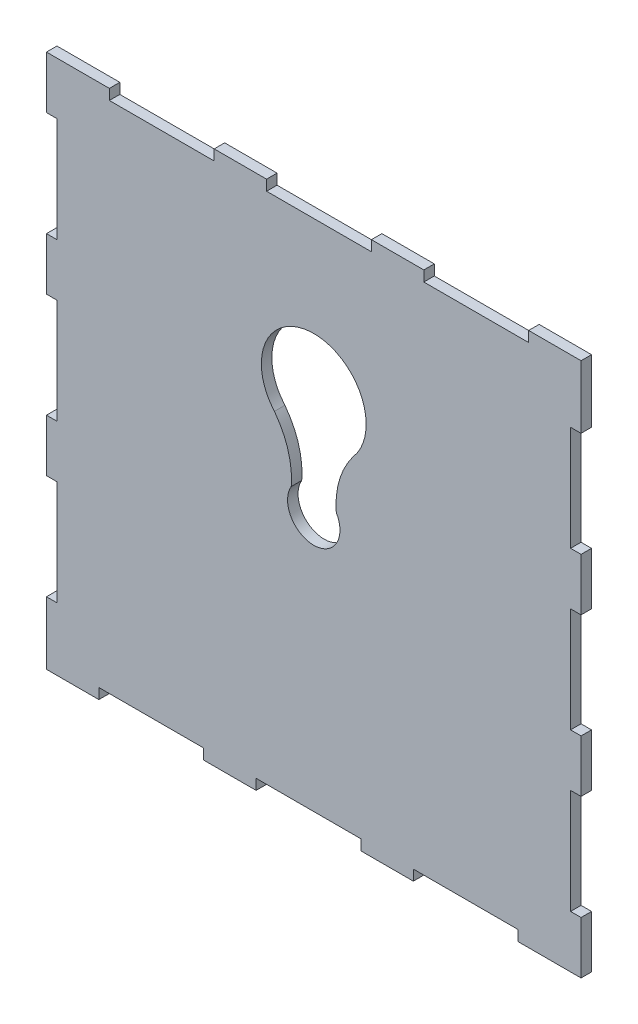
ISO-10303-21;
HEADER;
FILE_DESCRIPTION(('STEP AP214'),'2;1');
FILE_NAME('part.step','',(''),(''),'','','');
FILE_SCHEMA(('AUTOMOTIVE_DESIGN { 1 0 10303 214 1 1 1 1 }'));
ENDSEC;
DATA;
#1=APPLICATION_CONTEXT('core data for automotive mechanical design processes');
#2=APPLICATION_PROTOCOL_DEFINITION('international standard','automotive_design',2000,#1);
#3=PRODUCT_CONTEXT('',#1,'mechanical');
#4=PRODUCT('Part','Part','',(#3));
#5=PRODUCT_RELATED_PRODUCT_CATEGORY('part','',(#4));
#6=PRODUCT_DEFINITION_FORMATION('','',#4);
#7=PRODUCT_DEFINITION_CONTEXT('part definition',#1,'design');
#8=PRODUCT_DEFINITION('design','',#6,#7);
#9=PRODUCT_DEFINITION_SHAPE('','',#8);
#10=(LENGTH_UNIT() NAMED_UNIT(*) SI_UNIT(.MILLI.,.METRE.));
#11=(NAMED_UNIT(*) PLANE_ANGLE_UNIT() SI_UNIT($,.RADIAN.));
#12=(NAMED_UNIT(*) SI_UNIT($,.STERADIAN.) SOLID_ANGLE_UNIT());
#13=UNCERTAINTY_MEASURE_WITH_UNIT(LENGTH_MEASURE(1.E-05),#10,'distance_accuracy_value','');
#14=(GEOMETRIC_REPRESENTATION_CONTEXT(3) GLOBAL_UNCERTAINTY_ASSIGNED_CONTEXT((#13)) GLOBAL_UNIT_ASSIGNED_CONTEXT((#10,
#11,#12)) REPRESENTATION_CONTEXT('',''));
#15=CARTESIAN_POINT('',(0.,0.,0.));
#16=DIRECTION('',(0.,0.,1.));
#17=DIRECTION('',(1.,0.,0.));
#18=AXIS2_PLACEMENT_3D('',#15,#16,#17);
#19=CARTESIAN_POINT('',(-52.0000000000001,0.,-2.));
#20=DIRECTION('',(-1.,0.,0.));
#21=DIRECTION('',(0.,-1.,0.));
#22=AXIS2_PLACEMENT_3D('',#19,#20,#21);
#23=PLANE('',#22);
#24=DIRECTION('',(0.,-1.,0.));
#25=VECTOR('',#24,1.);
#26=CARTESIAN_POINT('',(-52.0000000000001,0.,0.));
#27=LINE('',#26,#25);
#28=CARTESIAN_POINT('',(-52.0000000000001,-90.,0.));
#29=VERTEX_POINT('',#28);
#30=CARTESIAN_POINT('',(-52.0000000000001,-102.,0.));
#31=VERTEX_POINT('',#30);
#32=EDGE_CURVE('E724',#29,#31,#27,.T.);
#33=ORIENTED_EDGE('',*,*,#32,.F.);
#34=DIRECTION('',(0.,0.,-1.));
#35=VECTOR('',#34,1.);
#36=CARTESIAN_POINT('',(-52.0000000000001,-90.,0.));
#37=LINE('',#36,#35);
#38=CARTESIAN_POINT('',(-52.0000000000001,-90.,-2.00000000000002));
#39=VERTEX_POINT('',#38);
#40=EDGE_CURVE('E985',#29,#39,#37,.T.);
#41=ORIENTED_EDGE('',*,*,#40,.T.);
#42=DIRECTION('',(0.,-1.,0.));
#43=VECTOR('',#42,1.);
#44=CARTESIAN_POINT('',(-52.0000000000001,0.,-2.));
#45=LINE('',#44,#43);
#46=CARTESIAN_POINT('',(-52.0000000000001,-102.,-2.));
#47=VERTEX_POINT('',#46);
#48=EDGE_CURVE('E667',#39,#47,#45,.T.);
#49=ORIENTED_EDGE('',*,*,#48,.T.);
#50=DIRECTION('',(0.,0.,1.));
#51=VECTOR('',#50,1.);
#52=CARTESIAN_POINT('',(-52.0000000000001,-102.,-2.));
#53=LINE('',#52,#51);
#54=EDGE_CURVE('E86',#47,#31,#53,.T.);
#55=ORIENTED_EDGE('',*,*,#54,.T.);
#56=EDGE_LOOP('',(#33,#41,#49,#55));
#57=FACE_BOUND('',#56,.T.);
#58=ADVANCED_FACE('F83',(#57),#23,.T.);
#59=CARTESIAN_POINT('',(-52.0000000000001,-60.,-2.00000000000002));
#60=VERTEX_POINT('',#59);
#61=CARTESIAN_POINT('',(-52.0000000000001,-70.,-2.00000000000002));
#62=VERTEX_POINT('',#61);
#63=EDGE_CURVE('E672',#60,#62,#45,.T.);
#64=ORIENTED_EDGE('',*,*,#63,.T.);
#65=DIRECTION('',(0.,0.,-1.));
#66=VECTOR('',#65,1.);
#67=CARTESIAN_POINT('',(-52.0000000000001,-70.,0.));
#68=LINE('',#67,#66);
#69=CARTESIAN_POINT('',(-52.0000000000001,-70.,0.));
#70=VERTEX_POINT('',#69);
#71=EDGE_CURVE('E983',#70,#62,#68,.T.);
#72=ORIENTED_EDGE('',*,*,#71,.F.);
#73=CARTESIAN_POINT('',(-52.0000000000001,-60.,0.));
#74=VERTEX_POINT('',#73);
#75=EDGE_CURVE('E727',#74,#70,#27,.T.);
#76=ORIENTED_EDGE('',*,*,#75,.F.);
#77=DIRECTION('',(0.,0.,-1.));
#78=VECTOR('',#77,1.);
#79=CARTESIAN_POINT('',(-52.0000000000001,-60.,0.));
#80=LINE('',#79,#78);
#81=EDGE_CURVE('E1006',#74,#60,#80,.T.);
#82=ORIENTED_EDGE('',*,*,#81,.T.);
#83=EDGE_LOOP('',(#64,#72,#76,#82));
#84=FACE_BOUND('',#83,.T.);
#85=ADVANCED_FACE('F639',(#84),#23,.T.);
#86=CARTESIAN_POINT('',(-52.0000000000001,-30.,-2.00000000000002));
#87=VERTEX_POINT('',#86);
#88=CARTESIAN_POINT('',(-52.0000000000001,-40.,-2.00000000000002));
#89=VERTEX_POINT('',#88);
#90=EDGE_CURVE('E665',#87,#89,#45,.T.);
#91=ORIENTED_EDGE('',*,*,#90,.T.);
#92=DIRECTION('',(0.,0.,-1.));
#93=VECTOR('',#92,1.);
#94=CARTESIAN_POINT('',(-52.0000000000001,-40.,0.));
#95=LINE('',#94,#93);
#96=CARTESIAN_POINT('',(-52.0000000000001,-40.,0.));
#97=VERTEX_POINT('',#96);
#98=EDGE_CURVE('E1004',#97,#89,#95,.T.);
#99=ORIENTED_EDGE('',*,*,#98,.F.);
#100=CARTESIAN_POINT('',(-52.0000000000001,-30.,0.));
#101=VERTEX_POINT('',#100);
#102=EDGE_CURVE('E723',#101,#97,#27,.T.);
#103=ORIENTED_EDGE('',*,*,#102,.F.);
#104=DIRECTION('',(0.,0.,-1.));
#105=VECTOR('',#104,1.);
#106=CARTESIAN_POINT('',(-52.0000000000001,-30.,0.));
#107=LINE('',#106,#105);
#108=EDGE_CURVE('E1029',#101,#87,#107,.T.);
#109=ORIENTED_EDGE('',*,*,#108,.T.);
#110=EDGE_LOOP('',(#91,#99,#103,#109));
#111=FACE_BOUND('',#110,.T.);
#112=ADVANCED_FACE('F645',(#111),#23,.T.);
#113=CARTESIAN_POINT('',(-52.0000000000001,0.,-2.));
#114=VERTEX_POINT('',#113);
#115=CARTESIAN_POINT('',(-52.0000000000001,-10.,-2.00000000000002));
#116=VERTEX_POINT('',#115);
#117=EDGE_CURVE('E657',#114,#116,#45,.T.);
#118=ORIENTED_EDGE('',*,*,#117,.T.);
#119=DIRECTION('',(0.,0.,-1.));
#120=VECTOR('',#119,1.);
#121=CARTESIAN_POINT('',(-52.0000000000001,-10.,0.));
#122=LINE('',#121,#120);
#123=CARTESIAN_POINT('',(-52.0000000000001,-10.,0.));
#124=VERTEX_POINT('',#123);
#125=EDGE_CURVE('E659',#124,#116,#122,.T.);
#126=ORIENTED_EDGE('',*,*,#125,.F.);
#127=CARTESIAN_POINT('',(-52.0000000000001,0.,0.));
#128=VERTEX_POINT('',#127);
#129=EDGE_CURVE('E719',#128,#124,#27,.T.);
#130=ORIENTED_EDGE('',*,*,#129,.F.);
#131=DIRECTION('',(0.,0.,1.));
#132=VECTOR('',#131,1.);
#133=CARTESIAN_POINT('',(-52.0000000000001,0.,-2.));
#134=LINE('',#133,#132);
#135=EDGE_CURVE('E12',#114,#128,#134,.T.);
#136=ORIENTED_EDGE('',*,*,#135,.F.);
#137=EDGE_LOOP('',(#118,#126,#130,#136));
#138=FACE_BOUND('',#137,.T.);
#139=ADVANCED_FACE('F615',(#138),#23,.T.);
#140=CARTESIAN_POINT('',(-52.0000000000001,0.,-2.));
#141=DIRECTION('',(0.,-1.,0.));
#142=DIRECTION('',(0.,0.,-1.));
#143=AXIS2_PLACEMENT_3D('',#140,#141,#142);
#144=PLANE('',#143);
#145=DIRECTION('',(0.,0.,-1.));
#146=VECTOR('',#145,1.);
#147=CARTESIAN_POINT('',(-40.,0.,0.));
#148=LINE('',#147,#146);
#149=CARTESIAN_POINT('',(-40.,0.,0.));
#150=VERTEX_POINT('',#149);
#151=CARTESIAN_POINT('',(-40.,0.,-2.));
#152=VERTEX_POINT('',#151);
#153=EDGE_CURVE('E918',#150,#152,#148,.T.);
#154=ORIENTED_EDGE('',*,*,#153,.T.);
#155=DIRECTION('',(1.,0.,0.));
#156=VECTOR('',#155,1.);
#157=CARTESIAN_POINT('',(-52.0000000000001,0.,-2.));
#158=LINE('',#157,#156);
#159=EDGE_CURVE('E1076',#114,#152,#158,.T.);
#160=ORIENTED_EDGE('',*,*,#159,.F.);
#161=ORIENTED_EDGE('',*,*,#135,.T.);
#162=DIRECTION('',(1.,0.,0.));
#163=VECTOR('',#162,1.);
#164=CARTESIAN_POINT('',(-52.0000000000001,0.,0.));
#165=LINE('',#164,#163);
#166=EDGE_CURVE('E674',#128,#150,#165,.T.);
#167=ORIENTED_EDGE('',*,*,#166,.T.);
#168=EDGE_LOOP('',(#154,#160,#161,#167));
#169=FACE_BOUND('',#168,.T.);
#170=ADVANCED_FACE('F611',(#169),#144,.F.);
#171=DIRECTION('',(0.,0.,-1.));
#172=VECTOR('',#171,1.);
#173=CARTESIAN_POINT('',(-20.,0.,0.));
#174=LINE('',#173,#172);
#175=CARTESIAN_POINT('',(-20.,0.,0.));
#176=VERTEX_POINT('',#175);
#177=CARTESIAN_POINT('',(-20.,0.,-2.));
#178=VERTEX_POINT('',#177);
#179=EDGE_CURVE('E916',#176,#178,#174,.T.);
#180=ORIENTED_EDGE('',*,*,#179,.F.);
#181=CARTESIAN_POINT('',(-10.,0.,0.));
#182=VERTEX_POINT('',#181);
#183=EDGE_CURVE('E681',#176,#182,#165,.T.);
#184=ORIENTED_EDGE('',*,*,#183,.T.);
#185=DIRECTION('',(0.,0.,-1.));
#186=VECTOR('',#185,1.);
#187=CARTESIAN_POINT('',(-10.,0.,0.));
#188=LINE('',#187,#186);
#189=CARTESIAN_POINT('',(-10.,0.,-2.));
#190=VERTEX_POINT('',#189);
#191=EDGE_CURVE('E939',#182,#190,#188,.T.);
#192=ORIENTED_EDGE('',*,*,#191,.T.);
#193=EDGE_CURVE('E1077',#178,#190,#158,.T.);
#194=ORIENTED_EDGE('',*,*,#193,.F.);
#195=EDGE_LOOP('',(#180,#184,#192,#194));
#196=FACE_BOUND('',#195,.T.);
#197=ADVANCED_FACE('F614',(#196),#144,.F.);
#198=DIRECTION('',(0.,0.,-1.));
#199=VECTOR('',#198,1.);
#200=CARTESIAN_POINT('',(9.99999999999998,0.,0.));
#201=LINE('',#200,#199);
#202=CARTESIAN_POINT('',(9.99999999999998,0.,0.));
#203=VERTEX_POINT('',#202);
#204=CARTESIAN_POINT('',(9.99999999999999,0.,-2.));
#205=VERTEX_POINT('',#204);
#206=EDGE_CURVE('E937',#203,#205,#201,.T.);
#207=ORIENTED_EDGE('',*,*,#206,.F.);
#208=CARTESIAN_POINT('',(20.,0.,0.));
#209=VERTEX_POINT('',#208);
#210=EDGE_CURVE('E687',#203,#209,#165,.T.);
#211=ORIENTED_EDGE('',*,*,#210,.T.);
#212=DIRECTION('',(0.,0.,-1.));
#213=VECTOR('',#212,1.);
#214=CARTESIAN_POINT('',(20.,0.,0.));
#215=LINE('',#214,#213);
#216=CARTESIAN_POINT('',(20.,0.,-2.));
#217=VERTEX_POINT('',#216);
#218=EDGE_CURVE('E963',#209,#217,#215,.T.);
#219=ORIENTED_EDGE('',*,*,#218,.T.);
#220=EDGE_CURVE('E1080',#205,#217,#158,.T.);
#221=ORIENTED_EDGE('',*,*,#220,.F.);
#222=EDGE_LOOP('',(#207,#211,#219,#221));
#223=FACE_BOUND('',#222,.T.);
#224=ADVANCED_FACE('F1086',(#223),#144,.F.);
#225=DIRECTION('',(0.,0.,-1.));
#226=VECTOR('',#225,1.);
#227=CARTESIAN_POINT('',(40.,0.,0.));
#228=LINE('',#227,#226);
#229=CARTESIAN_POINT('',(40.,0.,0.));
#230=VERTEX_POINT('',#229);
#231=CARTESIAN_POINT('',(40.,0.,-2.));
#232=VERTEX_POINT('',#231);
#233=EDGE_CURVE('E961',#230,#232,#228,.T.);
#234=ORIENTED_EDGE('',*,*,#233,.F.);
#235=CARTESIAN_POINT('',(50.,0.,0.));
#236=VERTEX_POINT('',#235);
#237=EDGE_CURVE('E683',#230,#236,#165,.T.);
#238=ORIENTED_EDGE('',*,*,#237,.T.);
#239=DIRECTION('',(0.,0.,1.));
#240=VECTOR('',#239,1.);
#241=CARTESIAN_POINT('',(50.,0.,-2.));
#242=LINE('',#241,#240);
#243=CARTESIAN_POINT('',(50.,0.,-2.));
#244=VERTEX_POINT('',#243);
#245=EDGE_CURVE('E91',#244,#236,#242,.T.);
#246=ORIENTED_EDGE('',*,*,#245,.F.);
#247=EDGE_CURVE('E1074',#232,#244,#158,.T.);
#248=ORIENTED_EDGE('',*,*,#247,.F.);
#249=EDGE_LOOP('',(#234,#238,#246,#248));
#250=FACE_BOUND('',#249,.T.);
#251=ADVANCED_FACE('F617',(#250),#144,.F.);
#252=CARTESIAN_POINT('',(50.,0.,-2.));
#253=DIRECTION('',(-1.,0.,0.));
#254=DIRECTION('',(0.,-1.,0.));
#255=AXIS2_PLACEMENT_3D('',#252,#253,#254);
#256=PLANE('',#255);
#257=DIRECTION('',(0.,0.,-1.));
#258=VECTOR('',#257,1.);
#259=CARTESIAN_POINT('',(50.,-12.,0.));
#260=LINE('',#259,#258);
#261=CARTESIAN_POINT('',(50.,-12.,0.));
#262=VERTEX_POINT('',#261);
#263=CARTESIAN_POINT('',(50.,-12.,-1.99999999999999));
#264=VERTEX_POINT('',#263);
#265=EDGE_CURVE('E851',#262,#264,#260,.T.);
#266=ORIENTED_EDGE('',*,*,#265,.T.);
#267=DIRECTION('',(0.,-1.,0.));
#268=VECTOR('',#267,1.);
#269=CARTESIAN_POINT('',(50.,0.,-2.));
#270=LINE('',#269,#268);
#271=EDGE_CURVE('E1072',#244,#264,#270,.T.);
#272=ORIENTED_EDGE('',*,*,#271,.F.);
#273=ORIENTED_EDGE('',*,*,#245,.T.);
#274=DIRECTION('',(0.,-1.,0.));
#275=VECTOR('',#274,1.);
#276=CARTESIAN_POINT('',(50.,0.,0.));
#277=LINE('',#276,#275);
#278=EDGE_CURVE('E689',#236,#262,#277,.T.);
#279=ORIENTED_EDGE('',*,*,#278,.T.);
#280=EDGE_LOOP('',(#266,#272,#273,#279));
#281=FACE_BOUND('',#280,.T.);
#282=ADVANCED_FACE('F618',(#281),#256,.F.);
#283=DIRECTION('',(0.,0.,-1.));
#284=VECTOR('',#283,1.);
#285=CARTESIAN_POINT('',(50.,-32.,0.));
#286=LINE('',#285,#284);
#287=CARTESIAN_POINT('',(50.,-32.,0.));
#288=VERTEX_POINT('',#287);
#289=CARTESIAN_POINT('',(50.,-32.,-1.99999999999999));
#290=VERTEX_POINT('',#289);
#291=EDGE_CURVE('E849',#288,#290,#286,.T.);
#292=ORIENTED_EDGE('',*,*,#291,.F.);
#293=CARTESIAN_POINT('',(50.,-42.,0.));
#294=VERTEX_POINT('',#293);
#295=EDGE_CURVE('E697',#288,#294,#277,.T.);
#296=ORIENTED_EDGE('',*,*,#295,.T.);
#297=DIRECTION('',(0.,0.,-1.));
#298=VECTOR('',#297,1.);
#299=CARTESIAN_POINT('',(50.,-42.,0.));
#300=LINE('',#299,#298);
#301=CARTESIAN_POINT('',(50.,-42.,-1.99999999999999));
#302=VERTEX_POINT('',#301);
#303=EDGE_CURVE('E872',#294,#302,#300,.T.);
#304=ORIENTED_EDGE('',*,*,#303,.T.);
#305=EDGE_CURVE('E1075',#290,#302,#270,.T.);
#306=ORIENTED_EDGE('',*,*,#305,.F.);
#307=EDGE_LOOP('',(#292,#296,#304,#306));
#308=FACE_BOUND('',#307,.T.);
#309=ADVANCED_FACE('F620',(#308),#256,.F.);
#310=DIRECTION('',(0.,0.,-1.));
#311=VECTOR('',#310,1.);
#312=CARTESIAN_POINT('',(50.,-62.,0.));
#313=LINE('',#312,#311);
#314=CARTESIAN_POINT('',(50.,-62.,0.));
#315=VERTEX_POINT('',#314);
#316=CARTESIAN_POINT('',(50.,-62.,-1.99999999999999));
#317=VERTEX_POINT('',#316);
#318=EDGE_CURVE('E870',#315,#317,#313,.T.);
#319=ORIENTED_EDGE('',*,*,#318,.F.);
#320=CARTESIAN_POINT('',(50.,-72.,0.));
#321=VERTEX_POINT('',#320);
#322=EDGE_CURVE('E702',#315,#321,#277,.T.);
#323=ORIENTED_EDGE('',*,*,#322,.T.);
#324=DIRECTION('',(0.,0.,-1.));
#325=VECTOR('',#324,1.);
#326=CARTESIAN_POINT('',(50.,-72.,0.));
#327=LINE('',#326,#325);
#328=CARTESIAN_POINT('',(50.,-72.,-1.99999999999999));
#329=VERTEX_POINT('',#328);
#330=EDGE_CURVE('E896',#321,#329,#327,.T.);
#331=ORIENTED_EDGE('',*,*,#330,.T.);
#332=EDGE_CURVE('E1106',#317,#329,#270,.T.);
#333=ORIENTED_EDGE('',*,*,#332,.F.);
#334=EDGE_LOOP('',(#319,#323,#331,#333));
#335=FACE_BOUND('',#334,.T.);
#336=ADVANCED_FACE('F633',(#335),#256,.F.);
#337=DIRECTION('',(0.,0.,-1.));
#338=VECTOR('',#337,1.);
#339=CARTESIAN_POINT('',(50.,-92.,0.));
#340=LINE('',#339,#338);
#341=CARTESIAN_POINT('',(50.,-92.,0.));
#342=VERTEX_POINT('',#341);
#343=CARTESIAN_POINT('',(50.,-92.,-1.99999999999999));
#344=VERTEX_POINT('',#343);
#345=EDGE_CURVE('E894',#342,#344,#340,.T.);
#346=ORIENTED_EDGE('',*,*,#345,.F.);
#347=CARTESIAN_POINT('',(50.,-102.,0.));
#348=VERTEX_POINT('',#347);
#349=EDGE_CURVE('E698',#342,#348,#277,.T.);
#350=ORIENTED_EDGE('',*,*,#349,.T.);
#351=DIRECTION('',(0.,0.,1.));
#352=VECTOR('',#351,1.);
#353=CARTESIAN_POINT('',(50.,-102.,-2.));
#354=LINE('',#353,#352);
#355=CARTESIAN_POINT('',(50.,-102.,-2.));
#356=VERTEX_POINT('',#355);
#357=EDGE_CURVE('E1078',#356,#348,#354,.T.);
#358=ORIENTED_EDGE('',*,*,#357,.F.);
#359=EDGE_CURVE('E1071',#344,#356,#270,.T.);
#360=ORIENTED_EDGE('',*,*,#359,.F.);
#361=EDGE_LOOP('',(#346,#350,#358,#360));
#362=FACE_BOUND('',#361,.T.);
#363=ADVANCED_FACE('F622',(#362),#256,.F.);
#364=CARTESIAN_POINT('',(-52.0000000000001,-102.,-2.));
#365=DIRECTION('',(0.,-1.,0.));
#366=DIRECTION('',(1.,0.,0.));
#367=AXIS2_PLACEMENT_3D('',#364,#365,#366);
#368=PLANE('',#367);
#369=DIRECTION('',(1.,0.,0.));
#370=VECTOR('',#369,1.);
#371=CARTESIAN_POINT('',(-52.0000000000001,-102.,0.));
#372=LINE('',#371,#370);
#373=CARTESIAN_POINT('',(37.9999999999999,-102.,0.));
#374=VERTEX_POINT('',#373);
#375=EDGE_CURVE('E712',#374,#348,#372,.T.);
#376=ORIENTED_EDGE('',*,*,#375,.F.);
#377=DIRECTION('',(0.,0.,-1.));
#378=VECTOR('',#377,1.);
#379=CARTESIAN_POINT('',(37.9999999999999,-102.,0.));
#380=LINE('',#379,#378);
#381=CARTESIAN_POINT('',(37.9999999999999,-102.,-2.00000000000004));
#382=VERTEX_POINT('',#381);
#383=EDGE_CURVE('E783',#374,#382,#380,.T.);
#384=ORIENTED_EDGE('',*,*,#383,.T.);
#385=DIRECTION('',(1.,0.,0.));
#386=VECTOR('',#385,1.);
#387=CARTESIAN_POINT('',(-52.0000000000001,-102.,-2.));
#388=LINE('',#387,#386);
#389=EDGE_CURVE('E664',#382,#356,#388,.T.);
#390=ORIENTED_EDGE('',*,*,#389,.T.);
#391=ORIENTED_EDGE('',*,*,#357,.T.);
#392=EDGE_LOOP('',(#376,#384,#390,#391));
#393=FACE_BOUND('',#392,.T.);
#394=ADVANCED_FACE('F623',(#393),#368,.T.);
#395=CARTESIAN_POINT('',(7.99999999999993,-102.,-2.00000000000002));
#396=VERTEX_POINT('',#395);
#397=CARTESIAN_POINT('',(17.9999999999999,-102.,-2.00000000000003));
#398=VERTEX_POINT('',#397);
#399=EDGE_CURVE('E668',#396,#398,#388,.T.);
#400=ORIENTED_EDGE('',*,*,#399,.T.);
#401=DIRECTION('',(0.,0.,-1.));
#402=VECTOR('',#401,1.);
#403=CARTESIAN_POINT('',(17.9999999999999,-102.,0.));
#404=LINE('',#403,#402);
#405=CARTESIAN_POINT('',(17.9999999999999,-102.,0.));
#406=VERTEX_POINT('',#405);
#407=EDGE_CURVE('E779',#406,#398,#404,.T.);
#408=ORIENTED_EDGE('',*,*,#407,.F.);
#409=CARTESIAN_POINT('',(7.99999999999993,-102.,0.));
#410=VERTEX_POINT('',#409);
#411=EDGE_CURVE('E717',#410,#406,#372,.T.);
#412=ORIENTED_EDGE('',*,*,#411,.F.);
#413=DIRECTION('',(0.,0.,-1.));
#414=VECTOR('',#413,1.);
#415=CARTESIAN_POINT('',(7.99999999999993,-102.,0.));
#416=LINE('',#415,#414);
#417=EDGE_CURVE('E805',#410,#396,#416,.T.);
#418=ORIENTED_EDGE('',*,*,#417,.T.);
#419=EDGE_LOOP('',(#400,#408,#412,#418));
#420=FACE_BOUND('',#419,.T.);
#421=ADVANCED_FACE('F625',(#420),#368,.T.);
#422=CARTESIAN_POINT('',(-22.0000000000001,-102.,-2.));
#423=VERTEX_POINT('',#422);
#424=CARTESIAN_POINT('',(-12.0000000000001,-102.,-2.00000000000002));
#425=VERTEX_POINT('',#424);
#426=EDGE_CURVE('E1067',#423,#425,#388,.T.);
#427=ORIENTED_EDGE('',*,*,#426,.T.);
#428=DIRECTION('',(0.,0.,-1.));
#429=VECTOR('',#428,1.);
#430=CARTESIAN_POINT('',(-12.0000000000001,-102.,0.));
#431=LINE('',#430,#429);
#432=CARTESIAN_POINT('',(-12.0000000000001,-102.,0.));
#433=VERTEX_POINT('',#432);
#434=EDGE_CURVE('E803',#433,#425,#431,.T.);
#435=ORIENTED_EDGE('',*,*,#434,.F.);
#436=CARTESIAN_POINT('',(-22.0000000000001,-102.,0.));
#437=VERTEX_POINT('',#436);
#438=EDGE_CURVE('E711',#437,#433,#372,.T.);
#439=ORIENTED_EDGE('',*,*,#438,.F.);
#440=DIRECTION('',(0.,0.,-1.));
#441=VECTOR('',#440,1.);
#442=CARTESIAN_POINT('',(-22.0000000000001,-102.,0.));
#443=LINE('',#442,#441);
#444=EDGE_CURVE('E829',#437,#423,#443,.T.);
#445=ORIENTED_EDGE('',*,*,#444,.T.);
#446=EDGE_LOOP('',(#427,#435,#439,#445));
#447=FACE_BOUND('',#446,.T.);
#448=ADVANCED_FACE('F631',(#447),#368,.T.);
#449=CARTESIAN_POINT('',(-42.0000000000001,-102.,-2.));
#450=VERTEX_POINT('',#449);
#451=EDGE_CURVE('E670',#47,#450,#388,.T.);
#452=ORIENTED_EDGE('',*,*,#451,.T.);
#453=DIRECTION('',(0.,0.,-1.));
#454=VECTOR('',#453,1.);
#455=CARTESIAN_POINT('',(-42.0000000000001,-102.,0.));
#456=LINE('',#455,#454);
#457=CARTESIAN_POINT('',(-42.0000000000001,-102.,0.));
#458=VERTEX_POINT('',#457);
#459=EDGE_CURVE('E827',#458,#450,#456,.T.);
#460=ORIENTED_EDGE('',*,*,#459,.F.);
#461=EDGE_CURVE('E704',#31,#458,#372,.T.);
#462=ORIENTED_EDGE('',*,*,#461,.F.);
#463=ORIENTED_EDGE('',*,*,#54,.F.);
#464=EDGE_LOOP('',(#452,#460,#462,#463));
#465=FACE_BOUND('',#464,.T.);
#466=ADVANCED_FACE('F609',(#465),#368,.T.);
#467=CARTESIAN_POINT('',(0.,0.,0.));
#468=DIRECTION('',(0.,0.,1.));
#469=DIRECTION('',(1.,0.,0.));
#470=AXIS2_PLACEMENT_3D('',#467,#468,#469);
#471=PLANE('',#470);
#472=CARTESIAN_POINT('',(-1.00000000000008,-51.,0.));
#473=DIRECTION('',(0.,0.,1.));
#474=DIRECTION('',(1.,0.,0.));
#475=AXIS2_PLACEMENT_3D('',#472,#473,#474);
#476=CIRCLE('',#475,5.);
#477=CARTESIAN_POINT('',(-5.29766775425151,-48.4446033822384,0.));
#478=VERTEX_POINT('',#477);
#479=CARTESIAN_POINT('',(3.29766775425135,-48.4446033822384,0.));
#480=VERTEX_POINT('',#479);
#481=EDGE_CURVE('E452',#478,#480,#476,.T.);
#482=ORIENTED_EDGE('',*,*,#481,.F.);
#483=CARTESIAN_POINT('',(-9.19152044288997,-36.7357643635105,0.));
#484=CARTESIAN_POINT('',(-4.82832048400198,-41.9739724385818,0.));
#485=CARTESIAN_POINT('',(-5.29766775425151,-48.4446033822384,0.));
#486=B_SPLINE_CURVE_WITH_KNOTS('',2,(#483,#484,#485),.UNSPECIFIED.,.F.,.F.,(3,3),(0.,1.),.UNSPECIFIED.);
#487=CARTESIAN_POINT('',(-8.50056377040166,-37.6137389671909,0.));
#488=VERTEX_POINT('',#487);
#489=EDGE_CURVE('E438',#488,#478,#486,.T.);
#490=ORIENTED_EDGE('',*,*,#489,.F.);
#491=CARTESIAN_POINT('',(-1.00000000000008,-31.,0.));
#492=DIRECTION('',(0.,0.,1.));
#493=DIRECTION('',(1.,0.,0.));
#494=AXIS2_PLACEMENT_3D('',#491,#492,#493);
#495=CIRCLE('',#494,10.);
#496=CARTESIAN_POINT('',(6.50056377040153,-37.6137389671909,0.));
#497=VERTEX_POINT('',#496);
#498=EDGE_CURVE('E451',#497,#488,#495,.T.);
#499=ORIENTED_EDGE('',*,*,#498,.F.);
#500=CARTESIAN_POINT('',(7.19152044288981,-36.7357643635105,0.));
#501=CARTESIAN_POINT('',(2.82832048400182,-41.9739724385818,0.));
#502=CARTESIAN_POINT('',(3.29766775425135,-48.4446033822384,0.));
#503=B_SPLINE_CURVE_WITH_KNOTS('',2,(#500,#501,#502),.UNSPECIFIED.,.F.,.F.,(3,3),(0.,1.),.UNSPECIFIED.);
#504=EDGE_CURVE('E99',#497,#480,#503,.T.);
#505=ORIENTED_EDGE('',*,*,#504,.T.);
#506=EDGE_LOOP('',(#482,#490,#499,#505));
#507=FACE_BOUND('',#506,.T.);
#508=DIRECTION('',(-1.,0.,0.));
#509=VECTOR('',#508,1.);
#510=CARTESIAN_POINT('',(37.9999999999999,-100.,0.));
#511=LINE('',#510,#509);
#512=CARTESIAN_POINT('',(37.9999999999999,-100.,0.));
#513=VERTEX_POINT('',#512);
#514=CARTESIAN_POINT('',(17.9999999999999,-100.,0.));
#515=VERTEX_POINT('',#514);
#516=EDGE_CURVE('E794',#513,#515,#511,.T.);
#517=ORIENTED_EDGE('',*,*,#516,.F.);
#518=DIRECTION('',(0.,1.,0.));
#519=VECTOR('',#518,1.);
#520=CARTESIAN_POINT('',(37.9999999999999,-102.,0.));
#521=LINE('',#520,#519);
#522=EDGE_CURVE('E789',#374,#513,#521,.T.);
#523=ORIENTED_EDGE('',*,*,#522,.F.);
#524=ORIENTED_EDGE('',*,*,#375,.T.);
#525=ORIENTED_EDGE('',*,*,#349,.F.);
#526=DIRECTION('',(1.,0.,0.));
#527=VECTOR('',#526,1.);
#528=CARTESIAN_POINT('',(50.,-92.,0.));
#529=LINE('',#528,#527);
#530=CARTESIAN_POINT('',(48.,-92.,0.));
#531=VERTEX_POINT('',#530);
#532=EDGE_CURVE('E899',#531,#342,#529,.T.);
#533=ORIENTED_EDGE('',*,*,#532,.F.);
#534=DIRECTION('',(0.,-1.,0.));
#535=VECTOR('',#534,1.);
#536=CARTESIAN_POINT('',(48.,-72.,0.));
#537=LINE('',#536,#535);
#538=CARTESIAN_POINT('',(48.,-72.,0.));
#539=VERTEX_POINT('',#538);
#540=EDGE_CURVE('E907',#539,#531,#537,.T.);
#541=ORIENTED_EDGE('',*,*,#540,.F.);
#542=DIRECTION('',(-1.,0.,0.));
#543=VECTOR('',#542,1.);
#544=CARTESIAN_POINT('',(50.,-72.,0.));
#545=LINE('',#544,#543);
#546=EDGE_CURVE('E902',#321,#539,#545,.T.);
#547=ORIENTED_EDGE('',*,*,#546,.F.);
#548=ORIENTED_EDGE('',*,*,#322,.F.);
#549=DIRECTION('',(1.,0.,0.));
#550=VECTOR('',#549,1.);
#551=CARTESIAN_POINT('',(50.,-62.,0.));
#552=LINE('',#551,#550);
#553=CARTESIAN_POINT('',(48.,-62.,0.));
#554=VERTEX_POINT('',#553);
#555=EDGE_CURVE('E875',#554,#315,#552,.T.);
#556=ORIENTED_EDGE('',*,*,#555,.F.);
#557=DIRECTION('',(0.,-1.,0.));
#558=VECTOR('',#557,1.);
#559=CARTESIAN_POINT('',(48.,-42.,0.));
#560=LINE('',#559,#558);
#561=CARTESIAN_POINT('',(48.,-42.,0.));
#562=VERTEX_POINT('',#561);
#563=EDGE_CURVE('E885',#562,#554,#560,.T.);
#564=ORIENTED_EDGE('',*,*,#563,.F.);
#565=DIRECTION('',(-1.,0.,0.));
#566=VECTOR('',#565,1.);
#567=CARTESIAN_POINT('',(50.,-42.,0.));
#568=LINE('',#567,#566);
#569=EDGE_CURVE('E879',#294,#562,#568,.T.);
#570=ORIENTED_EDGE('',*,*,#569,.F.);
#571=ORIENTED_EDGE('',*,*,#295,.F.);
#572=DIRECTION('',(1.,0.,0.));
#573=VECTOR('',#572,1.);
#574=CARTESIAN_POINT('',(50.,-32.,0.));
#575=LINE('',#574,#573);
#576=CARTESIAN_POINT('',(48.,-32.,0.));
#577=VERTEX_POINT('',#576);
#578=EDGE_CURVE('E853',#577,#288,#575,.T.);
#579=ORIENTED_EDGE('',*,*,#578,.F.);
#580=DIRECTION('',(0.,-1.,0.));
#581=VECTOR('',#580,1.);
#582=CARTESIAN_POINT('',(48.,-12.,0.));
#583=LINE('',#582,#581);
#584=CARTESIAN_POINT('',(48.,-12.,0.));
#585=VERTEX_POINT('',#584);
#586=EDGE_CURVE('E861',#585,#577,#583,.T.);
#587=ORIENTED_EDGE('',*,*,#586,.F.);
#588=DIRECTION('',(-1.,0.,0.));
#589=VECTOR('',#588,1.);
#590=CARTESIAN_POINT('',(50.,-12.,0.));
#591=LINE('',#590,#589);
#592=EDGE_CURVE('E856',#262,#585,#591,.T.);
#593=ORIENTED_EDGE('',*,*,#592,.F.);
#594=ORIENTED_EDGE('',*,*,#278,.F.);
#595=ORIENTED_EDGE('',*,*,#237,.F.);
#596=DIRECTION('',(0.,1.,0.));
#597=VECTOR('',#596,1.);
#598=CARTESIAN_POINT('',(40.,0.,0.));
#599=LINE('',#598,#597);
#600=CARTESIAN_POINT('',(40.,-2.,0.));
#601=VERTEX_POINT('',#600);
#602=EDGE_CURVE('E966',#601,#230,#599,.T.);
#603=ORIENTED_EDGE('',*,*,#602,.F.);
#604=DIRECTION('',(1.,0.,0.));
#605=VECTOR('',#604,1.);
#606=CARTESIAN_POINT('',(20.,-2.,0.));
#607=LINE('',#606,#605);
#608=CARTESIAN_POINT('',(20.,-2.,0.));
#609=VERTEX_POINT('',#608);
#610=EDGE_CURVE('E974',#609,#601,#607,.T.);
#611=ORIENTED_EDGE('',*,*,#610,.F.);
#612=DIRECTION('',(0.,-1.,0.));
#613=VECTOR('',#612,1.);
#614=CARTESIAN_POINT('',(20.,0.,0.));
#615=LINE('',#614,#613);
#616=EDGE_CURVE('E969',#209,#609,#615,.T.);
#617=ORIENTED_EDGE('',*,*,#616,.F.);
#618=ORIENTED_EDGE('',*,*,#210,.F.);
#619=DIRECTION('',(0.,1.,0.));
#620=VECTOR('',#619,1.);
#621=CARTESIAN_POINT('',(9.99999999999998,0.,0.));
#622=LINE('',#621,#620);
#623=CARTESIAN_POINT('',(9.99999999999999,-2.,0.));
#624=VERTEX_POINT('',#623);
#625=EDGE_CURVE('E942',#624,#203,#622,.T.);
#626=ORIENTED_EDGE('',*,*,#625,.F.);
#627=DIRECTION('',(1.,0.,0.));
#628=VECTOR('',#627,1.);
#629=CARTESIAN_POINT('',(-10.,-2.,0.));
#630=LINE('',#629,#628);
#631=CARTESIAN_POINT('',(-10.,-2.,0.));
#632=VERTEX_POINT('',#631);
#633=EDGE_CURVE('E952',#632,#624,#630,.T.);
#634=ORIENTED_EDGE('',*,*,#633,.F.);
#635=DIRECTION('',(0.,-1.,0.));
#636=VECTOR('',#635,1.);
#637=CARTESIAN_POINT('',(-10.,0.,0.));
#638=LINE('',#637,#636);
#639=EDGE_CURVE('E946',#182,#632,#638,.T.);
#640=ORIENTED_EDGE('',*,*,#639,.F.);
#641=ORIENTED_EDGE('',*,*,#183,.F.);
#642=DIRECTION('',(0.,1.,0.));
#643=VECTOR('',#642,1.);
#644=CARTESIAN_POINT('',(-20.,0.,0.));
#645=LINE('',#644,#643);
#646=CARTESIAN_POINT('',(-20.,-2.,0.));
#647=VERTEX_POINT('',#646);
#648=EDGE_CURVE('E920',#647,#176,#645,.T.);
#649=ORIENTED_EDGE('',*,*,#648,.F.);
#650=DIRECTION('',(1.,0.,0.));
#651=VECTOR('',#650,1.);
#652=CARTESIAN_POINT('',(-40.,-2.,0.));
#653=LINE('',#652,#651);
#654=CARTESIAN_POINT('',(-40.,-2.,0.));
#655=VERTEX_POINT('',#654);
#656=EDGE_CURVE('E928',#655,#647,#653,.T.);
#657=ORIENTED_EDGE('',*,*,#656,.F.);
#658=DIRECTION('',(0.,-1.,0.));
#659=VECTOR('',#658,1.);
#660=CARTESIAN_POINT('',(-40.,0.,0.));
#661=LINE('',#660,#659);
#662=EDGE_CURVE('E923',#150,#655,#661,.T.);
#663=ORIENTED_EDGE('',*,*,#662,.F.);
#664=ORIENTED_EDGE('',*,*,#166,.F.);
#665=ORIENTED_EDGE('',*,*,#129,.T.);
#666=DIRECTION('',(-1.,0.,0.));
#667=VECTOR('',#666,1.);
#668=CARTESIAN_POINT('',(-52.0000000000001,-10.,0.));
#669=LINE('',#668,#667);
#670=CARTESIAN_POINT('',(-50.0000000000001,-10.,0.));
#671=VERTEX_POINT('',#670);
#672=EDGE_CURVE('E1032',#671,#124,#669,.T.);
#673=ORIENTED_EDGE('',*,*,#672,.F.);
#674=DIRECTION('',(0.,1.,0.));
#675=VECTOR('',#674,1.);
#676=CARTESIAN_POINT('',(-50.0000000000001,-30.,0.));
#677=LINE('',#676,#675);
#678=CARTESIAN_POINT('',(-50.0000000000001,-30.,0.));
#679=VERTEX_POINT('',#678);
#680=EDGE_CURVE('E1040',#679,#671,#677,.T.);
#681=ORIENTED_EDGE('',*,*,#680,.F.);
#682=DIRECTION('',(1.,0.,0.));
#683=VECTOR('',#682,1.);
#684=CARTESIAN_POINT('',(-52.0000000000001,-30.,0.));
#685=LINE('',#684,#683);
#686=EDGE_CURVE('E1035',#101,#679,#685,.T.);
#687=ORIENTED_EDGE('',*,*,#686,.F.);
#688=ORIENTED_EDGE('',*,*,#102,.T.);
#689=DIRECTION('',(-1.,0.,0.));
#690=VECTOR('',#689,1.);
#691=CARTESIAN_POINT('',(-52.0000000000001,-40.,0.));
#692=LINE('',#691,#690);
#693=CARTESIAN_POINT('',(-50.0000000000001,-40.,0.));
#694=VERTEX_POINT('',#693);
#695=EDGE_CURVE('E1009',#694,#97,#692,.T.);
#696=ORIENTED_EDGE('',*,*,#695,.F.);
#697=DIRECTION('',(0.,1.,0.));
#698=VECTOR('',#697,1.);
#699=CARTESIAN_POINT('',(-50.0000000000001,-60.,0.));
#700=LINE('',#699,#698);
#701=CARTESIAN_POINT('',(-50.0000000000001,-60.,0.));
#702=VERTEX_POINT('',#701);
#703=EDGE_CURVE('E1019',#702,#694,#700,.T.);
#704=ORIENTED_EDGE('',*,*,#703,.F.);
#705=DIRECTION('',(1.,0.,0.));
#706=VECTOR('',#705,1.);
#707=CARTESIAN_POINT('',(-52.0000000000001,-60.,0.));
#708=LINE('',#707,#706);
#709=EDGE_CURVE('E1013',#74,#702,#708,.T.);
#710=ORIENTED_EDGE('',*,*,#709,.F.);
#711=ORIENTED_EDGE('',*,*,#75,.T.);
#712=DIRECTION('',(-1.,0.,0.));
#713=VECTOR('',#712,1.);
#714=CARTESIAN_POINT('',(-52.0000000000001,-70.,0.));
#715=LINE('',#714,#713);
#716=CARTESIAN_POINT('',(-50.0000000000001,-70.,0.));
#717=VERTEX_POINT('',#716);
#718=EDGE_CURVE('E987',#717,#70,#715,.T.);
#719=ORIENTED_EDGE('',*,*,#718,.F.);
#720=DIRECTION('',(0.,1.,0.));
#721=VECTOR('',#720,1.);
#722=CARTESIAN_POINT('',(-50.0000000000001,-90.,0.));
#723=LINE('',#722,#721);
#724=CARTESIAN_POINT('',(-50.0000000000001,-90.,0.));
#725=VERTEX_POINT('',#724);
#726=EDGE_CURVE('E995',#725,#717,#723,.T.);
#727=ORIENTED_EDGE('',*,*,#726,.F.);
#728=DIRECTION('',(1.,0.,0.));
#729=VECTOR('',#728,1.);
#730=CARTESIAN_POINT('',(-52.0000000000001,-90.,0.));
#731=LINE('',#730,#729);
#732=EDGE_CURVE('E990',#29,#725,#731,.T.);
#733=ORIENTED_EDGE('',*,*,#732,.F.);
#734=ORIENTED_EDGE('',*,*,#32,.T.);
#735=ORIENTED_EDGE('',*,*,#461,.T.);
#736=DIRECTION('',(0.,-1.,0.));
#737=VECTOR('',#736,1.);
#738=CARTESIAN_POINT('',(-42.0000000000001,-102.,0.));
#739=LINE('',#738,#737);
#740=CARTESIAN_POINT('',(-42.0000000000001,-100.,0.));
#741=VERTEX_POINT('',#740);
#742=EDGE_CURVE('E832',#741,#458,#739,.T.);
#743=ORIENTED_EDGE('',*,*,#742,.F.);
#744=DIRECTION('',(-1.,0.,0.));
#745=VECTOR('',#744,1.);
#746=CARTESIAN_POINT('',(-22.0000000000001,-100.,0.));
#747=LINE('',#746,#745);
#748=CARTESIAN_POINT('',(-22.0000000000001,-100.,0.));
#749=VERTEX_POINT('',#748);
#750=EDGE_CURVE('E840',#749,#741,#747,.T.);
#751=ORIENTED_EDGE('',*,*,#750,.F.);
#752=DIRECTION('',(0.,1.,0.));
#753=VECTOR('',#752,1.);
#754=CARTESIAN_POINT('',(-22.0000000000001,-102.,0.));
#755=LINE('',#754,#753);
#756=EDGE_CURVE('E835',#437,#749,#755,.T.);
#757=ORIENTED_EDGE('',*,*,#756,.F.);
#758=ORIENTED_EDGE('',*,*,#438,.T.);
#759=DIRECTION('',(0.,-1.,0.));
#760=VECTOR('',#759,1.);
#761=CARTESIAN_POINT('',(-12.0000000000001,-102.,0.));
#762=LINE('',#761,#760);
#763=CARTESIAN_POINT('',(-12.0000000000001,-100.,0.));
#764=VERTEX_POINT('',#763);
#765=EDGE_CURVE('E808',#764,#433,#762,.T.);
#766=ORIENTED_EDGE('',*,*,#765,.F.);
#767=DIRECTION('',(-1.,0.,0.));
#768=VECTOR('',#767,1.);
#769=CARTESIAN_POINT('',(7.99999999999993,-100.,0.));
#770=LINE('',#769,#768);
#771=CARTESIAN_POINT('',(7.99999999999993,-100.,0.));
#772=VERTEX_POINT('',#771);
#773=EDGE_CURVE('E818',#772,#764,#770,.T.);
#774=ORIENTED_EDGE('',*,*,#773,.F.);
#775=DIRECTION('',(0.,1.,0.));
#776=VECTOR('',#775,1.);
#777=CARTESIAN_POINT('',(7.99999999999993,-102.,0.));
#778=LINE('',#777,#776);
#779=EDGE_CURVE('E812',#410,#772,#778,.T.);
#780=ORIENTED_EDGE('',*,*,#779,.F.);
#781=ORIENTED_EDGE('',*,*,#411,.T.);
#782=DIRECTION('',(0.,-1.,0.));
#783=VECTOR('',#782,1.);
#784=CARTESIAN_POINT('',(17.9999999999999,-102.,0.));
#785=LINE('',#784,#783);
#786=EDGE_CURVE('E786',#515,#406,#785,.T.);
#787=ORIENTED_EDGE('',*,*,#786,.F.);
#788=EDGE_LOOP('',(#517,#523,#524,#525,#533,#541,#547,#548,#556,#564,#570,#571,#579,#587,#593,
#594,#595,#603,#611,#617,#618,#626,#634,#640,#641,#649,#657,#663,#664,#665,#673,#681,#687,#688,
#696,#704,#710,#711,#719,#727,#733,#734,#735,#743,#751,#757,#758,#766,#774,#780,#781,#787));
#789=FACE_BOUND('',#788,.T.);
#790=ADVANCED_FACE('F606',(#507,#789),#471,.T.);
#791=CARTESIAN_POINT('',(0.,0.,-2.));
#792=DIRECTION('',(0.,0.,1.));
#793=DIRECTION('',(1.,0.,0.));
#794=AXIS2_PLACEMENT_3D('',#791,#792,#793);
#795=PLANE('',#794);
#796=CARTESIAN_POINT('',(-9.19152044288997,-36.7357643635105,-2.));
#797=CARTESIAN_POINT('',(-4.82832048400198,-41.9739724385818,-2.));
#798=CARTESIAN_POINT('',(-5.29766775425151,-48.4446033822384,-2.));
#799=B_SPLINE_CURVE_WITH_KNOTS('',2,(#796,#797,#798),.UNSPECIFIED.,.F.,.F.,(3,3),(0.,1.),.UNSPECIFIED.);
#800=CARTESIAN_POINT('',(-8.50056377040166,-37.6137389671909,-2.));
#801=VERTEX_POINT('',#800);
#802=CARTESIAN_POINT('',(-5.29766775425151,-48.4446033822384,-2.));
#803=VERTEX_POINT('',#802);
#804=EDGE_CURVE('E107',#801,#803,#799,.T.);
#805=ORIENTED_EDGE('',*,*,#804,.T.);
#806=CARTESIAN_POINT('',(-1.00000000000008,-51.,-2.));
#807=DIRECTION('',(0.,0.,1.));
#808=DIRECTION('',(1.,0.,0.));
#809=AXIS2_PLACEMENT_3D('',#806,#807,#808);
#810=CIRCLE('',#809,5.);
#811=CARTESIAN_POINT('',(3.29766775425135,-48.4446033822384,-2.));
#812=VERTEX_POINT('',#811);
#813=EDGE_CURVE('E446',#803,#812,#810,.T.);
#814=ORIENTED_EDGE('',*,*,#813,.T.);
#815=CARTESIAN_POINT('',(7.19152044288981,-36.7357643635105,-2.));
#816=CARTESIAN_POINT('',(2.82832048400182,-41.9739724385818,-2.));
#817=CARTESIAN_POINT('',(3.29766775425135,-48.4446033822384,-2.));
#818=B_SPLINE_CURVE_WITH_KNOTS('',2,(#815,#816,#817),.UNSPECIFIED.,.F.,.F.,(3,3),(0.,1.),.UNSPECIFIED.);
#819=CARTESIAN_POINT('',(6.50056377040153,-37.6137389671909,-2.));
#820=VERTEX_POINT('',#819);
#821=EDGE_CURVE('E459',#820,#812,#818,.T.);
#822=ORIENTED_EDGE('',*,*,#821,.F.);
#823=CARTESIAN_POINT('',(-1.00000000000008,-31.,-2.));
#824=DIRECTION('',(0.,0.,1.));
#825=DIRECTION('',(1.,0.,0.));
#826=AXIS2_PLACEMENT_3D('',#823,#824,#825);
#827=CIRCLE('',#826,10.);
#828=EDGE_CURVE('E458',#820,#801,#827,.T.);
#829=ORIENTED_EDGE('',*,*,#828,.T.);
#830=EDGE_LOOP('',(#805,#814,#822,#829));
#831=FACE_BOUND('',#830,.T.);
#832=DIRECTION('',(0.,1.,0.));
#833=VECTOR('',#832,1.);
#834=CARTESIAN_POINT('',(37.9999999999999,-102.,-2.00000000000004));
#835=LINE('',#834,#833);
#836=CARTESIAN_POINT('',(37.9999999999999,-100.,-2.00000000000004));
#837=VERTEX_POINT('',#836);
#838=EDGE_CURVE('E790',#382,#837,#835,.T.);
#839=ORIENTED_EDGE('',*,*,#838,.T.);
#840=DIRECTION('',(-1.,0.,0.));
#841=VECTOR('',#840,1.);
#842=CARTESIAN_POINT('',(0.,-100.,-2.));
#843=LINE('',#842,#841);
#844=CARTESIAN_POINT('',(17.9999999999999,-100.,-2.00000000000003));
#845=VERTEX_POINT('',#844);
#846=EDGE_CURVE('E729',#837,#845,#843,.T.);
#847=ORIENTED_EDGE('',*,*,#846,.T.);
#848=DIRECTION('',(0.,-1.,0.));
#849=VECTOR('',#848,1.);
#850=CARTESIAN_POINT('',(17.9999999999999,-102.,-2.00000000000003));
#851=LINE('',#850,#849);
#852=EDGE_CURVE('E787',#845,#398,#851,.T.);
#853=ORIENTED_EDGE('',*,*,#852,.T.);
#854=ORIENTED_EDGE('',*,*,#399,.F.);
#855=DIRECTION('',(0.,1.,0.));
#856=VECTOR('',#855,1.);
#857=CARTESIAN_POINT('',(7.99999999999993,-102.,-2.00000000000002));
#858=LINE('',#857,#856);
#859=CARTESIAN_POINT('',(7.99999999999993,-100.,-2.00000000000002));
#860=VERTEX_POINT('',#859);
#861=EDGE_CURVE('E813',#396,#860,#858,.T.);
#862=ORIENTED_EDGE('',*,*,#861,.T.);
#863=CARTESIAN_POINT('',(-12.0000000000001,-100.,-2.00000000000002));
#864=VERTEX_POINT('',#863);
#865=EDGE_CURVE('E733',#860,#864,#843,.T.);
#866=ORIENTED_EDGE('',*,*,#865,.T.);
#867=DIRECTION('',(0.,-1.,0.));
#868=VECTOR('',#867,1.);
#869=CARTESIAN_POINT('',(-12.0000000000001,-102.,-2.00000000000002));
#870=LINE('',#869,#868);
#871=EDGE_CURVE('E809',#864,#425,#870,.T.);
#872=ORIENTED_EDGE('',*,*,#871,.T.);
#873=ORIENTED_EDGE('',*,*,#426,.F.);
#874=DIRECTION('',(0.,1.,0.));
#875=VECTOR('',#874,1.);
#876=CARTESIAN_POINT('',(-22.0000000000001,-102.,-2.));
#877=LINE('',#876,#875);
#878=CARTESIAN_POINT('',(-22.0000000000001,-100.,-2.));
#879=VERTEX_POINT('',#878);
#880=EDGE_CURVE('E836',#423,#879,#877,.T.);
#881=ORIENTED_EDGE('',*,*,#880,.T.);
#882=CARTESIAN_POINT('',(-42.0000000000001,-100.,-2.));
#883=VERTEX_POINT('',#882);
#884=EDGE_CURVE('E734',#879,#883,#843,.T.);
#885=ORIENTED_EDGE('',*,*,#884,.T.);
#886=DIRECTION('',(0.,-1.,0.));
#887=VECTOR('',#886,1.);
#888=CARTESIAN_POINT('',(-42.0000000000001,-102.,-2.));
#889=LINE('',#888,#887);
#890=EDGE_CURVE('E833',#883,#450,#889,.T.);
#891=ORIENTED_EDGE('',*,*,#890,.T.);
#892=ORIENTED_EDGE('',*,*,#451,.F.);
#893=ORIENTED_EDGE('',*,*,#48,.F.);
#894=DIRECTION('',(1.,0.,0.));
#895=VECTOR('',#894,1.);
#896=CARTESIAN_POINT('',(-52.0000000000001,-90.,-2.00000000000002));
#897=LINE('',#896,#895);
#898=CARTESIAN_POINT('',(-50.0000000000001,-90.,-2.00000000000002));
#899=VERTEX_POINT('',#898);
#900=EDGE_CURVE('E991',#39,#899,#897,.T.);
#901=ORIENTED_EDGE('',*,*,#900,.T.);
#902=DIRECTION('',(0.,1.,0.));
#903=VECTOR('',#902,1.);
#904=CARTESIAN_POINT('',(-50.0000000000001,0.,-2.));
#905=LINE('',#904,#903);
#906=CARTESIAN_POINT('',(-50.0000000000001,-70.,-2.00000000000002));
#907=VERTEX_POINT('',#906);
#908=EDGE_CURVE('E762',#899,#907,#905,.T.);
#909=ORIENTED_EDGE('',*,*,#908,.T.);
#910=DIRECTION('',(-1.,0.,0.));
#911=VECTOR('',#910,1.);
#912=CARTESIAN_POINT('',(-52.0000000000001,-70.,-2.00000000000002));
#913=LINE('',#912,#911);
#914=EDGE_CURVE('E988',#907,#62,#913,.T.);
#915=ORIENTED_EDGE('',*,*,#914,.T.);
#916=ORIENTED_EDGE('',*,*,#63,.F.);
#917=DIRECTION('',(1.,0.,0.));
#918=VECTOR('',#917,1.);
#919=CARTESIAN_POINT('',(-52.0000000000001,-60.,-2.00000000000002));
#920=LINE('',#919,#918);
#921=CARTESIAN_POINT('',(-50.0000000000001,-60.,-2.00000000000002));
#922=VERTEX_POINT('',#921);
#923=EDGE_CURVE('E1014',#60,#922,#920,.T.);
#924=ORIENTED_EDGE('',*,*,#923,.T.);
#925=CARTESIAN_POINT('',(-50.0000000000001,-40.,-2.00000000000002));
#926=VERTEX_POINT('',#925);
#927=EDGE_CURVE('E766',#922,#926,#905,.T.);
#928=ORIENTED_EDGE('',*,*,#927,.T.);
#929=DIRECTION('',(-1.,0.,0.));
#930=VECTOR('',#929,1.);
#931=CARTESIAN_POINT('',(-52.0000000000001,-40.,-2.00000000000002));
#932=LINE('',#931,#930);
#933=EDGE_CURVE('E1010',#926,#89,#932,.T.);
#934=ORIENTED_EDGE('',*,*,#933,.T.);
#935=ORIENTED_EDGE('',*,*,#90,.F.);
#936=DIRECTION('',(1.,0.,0.));
#937=VECTOR('',#936,1.);
#938=CARTESIAN_POINT('',(-52.0000000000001,-30.,-2.00000000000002));
#939=LINE('',#938,#937);
#940=CARTESIAN_POINT('',(-50.0000000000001,-30.,-2.00000000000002));
#941=VERTEX_POINT('',#940);
#942=EDGE_CURVE('E1036',#87,#941,#939,.T.);
#943=ORIENTED_EDGE('',*,*,#942,.T.);
#944=CARTESIAN_POINT('',(-50.0000000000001,-10.,-2.00000000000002));
#945=VERTEX_POINT('',#944);
#946=EDGE_CURVE('E767',#941,#945,#905,.T.);
#947=ORIENTED_EDGE('',*,*,#946,.T.);
#948=DIRECTION('',(-1.,0.,0.));
#949=VECTOR('',#948,1.);
#950=CARTESIAN_POINT('',(-52.0000000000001,-10.,-2.00000000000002));
#951=LINE('',#950,#949);
#952=EDGE_CURVE('E1033',#945,#116,#951,.T.);
#953=ORIENTED_EDGE('',*,*,#952,.T.);
#954=ORIENTED_EDGE('',*,*,#117,.F.);
#955=ORIENTED_EDGE('',*,*,#159,.T.);
#956=DIRECTION('',(0.,-1.,0.));
#957=VECTOR('',#956,1.);
#958=CARTESIAN_POINT('',(-40.,0.,-2.));
#959=LINE('',#958,#957);
#960=CARTESIAN_POINT('',(-40.,-2.,-2.));
#961=VERTEX_POINT('',#960);
#962=EDGE_CURVE('E924',#152,#961,#959,.T.);
#963=ORIENTED_EDGE('',*,*,#962,.T.);
#964=DIRECTION('',(1.,0.,0.));
#965=VECTOR('',#964,1.);
#966=CARTESIAN_POINT('',(0.,-2.,-2.));
#967=LINE('',#966,#965);
#968=CARTESIAN_POINT('',(-20.,-2.,-2.));
#969=VERTEX_POINT('',#968);
#970=EDGE_CURVE('E751',#961,#969,#967,.T.);
#971=ORIENTED_EDGE('',*,*,#970,.T.);
#972=DIRECTION('',(0.,1.,0.));
#973=VECTOR('',#972,1.);
#974=CARTESIAN_POINT('',(-20.,0.,-2.));
#975=LINE('',#974,#973);
#976=EDGE_CURVE('E921',#969,#178,#975,.T.);
#977=ORIENTED_EDGE('',*,*,#976,.T.);
#978=ORIENTED_EDGE('',*,*,#193,.T.);
#979=DIRECTION('',(0.,-1.,0.));
#980=VECTOR('',#979,1.);
#981=CARTESIAN_POINT('',(-10.,0.,-2.));
#982=LINE('',#981,#980);
#983=CARTESIAN_POINT('',(-10.,-2.,-2.));
#984=VERTEX_POINT('',#983);
#985=EDGE_CURVE('E947',#190,#984,#982,.T.);
#986=ORIENTED_EDGE('',*,*,#985,.T.);
#987=CARTESIAN_POINT('',(9.99999999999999,-2.,-2.));
#988=VERTEX_POINT('',#987);
#989=EDGE_CURVE('E755',#984,#988,#967,.T.);
#990=ORIENTED_EDGE('',*,*,#989,.T.);
#991=DIRECTION('',(0.,1.,0.));
#992=VECTOR('',#991,1.);
#993=CARTESIAN_POINT('',(9.99999999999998,0.,-2.));
#994=LINE('',#993,#992);
#995=EDGE_CURVE('E943',#988,#205,#994,.T.);
#996=ORIENTED_EDGE('',*,*,#995,.T.);
#997=ORIENTED_EDGE('',*,*,#220,.T.);
#998=DIRECTION('',(0.,-1.,0.));
#999=VECTOR('',#998,1.);
#1000=CARTESIAN_POINT('',(20.,0.,-2.));
#1001=LINE('',#1000,#999);
#1002=CARTESIAN_POINT('',(20.,-2.,-2.));
#1003=VERTEX_POINT('',#1002);
#1004=EDGE_CURVE('E970',#217,#1003,#1001,.T.);
#1005=ORIENTED_EDGE('',*,*,#1004,.T.);
#1006=CARTESIAN_POINT('',(40.,-2.,-2.));
#1007=VERTEX_POINT('',#1006);
#1008=EDGE_CURVE('E756',#1003,#1007,#967,.T.);
#1009=ORIENTED_EDGE('',*,*,#1008,.T.);
#1010=DIRECTION('',(0.,1.,0.));
#1011=VECTOR('',#1010,1.);
#1012=CARTESIAN_POINT('',(40.,0.,-2.));
#1013=LINE('',#1012,#1011);
#1014=EDGE_CURVE('E967',#1007,#232,#1013,.T.);
#1015=ORIENTED_EDGE('',*,*,#1014,.T.);
#1016=ORIENTED_EDGE('',*,*,#247,.T.);
#1017=ORIENTED_EDGE('',*,*,#271,.T.);
#1018=DIRECTION('',(-1.,0.,0.));
#1019=VECTOR('',#1018,1.);
#1020=CARTESIAN_POINT('',(50.,-12.,-1.99999999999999));
#1021=LINE('',#1020,#1019);
#1022=CARTESIAN_POINT('',(48.,-12.,-1.99999999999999));
#1023=VERTEX_POINT('',#1022);
#1024=EDGE_CURVE('E857',#264,#1023,#1021,.T.);
#1025=ORIENTED_EDGE('',*,*,#1024,.T.);
#1026=DIRECTION('',(0.,-1.,0.));
#1027=VECTOR('',#1026,1.);
#1028=CARTESIAN_POINT('',(48.,0.,-2.));
#1029=LINE('',#1028,#1027);
#1030=CARTESIAN_POINT('',(48.,-32.,-1.99999999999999));
#1031=VERTEX_POINT('',#1030);
#1032=EDGE_CURVE('E740',#1023,#1031,#1029,.T.);
#1033=ORIENTED_EDGE('',*,*,#1032,.T.);
#1034=DIRECTION('',(1.,0.,0.));
#1035=VECTOR('',#1034,1.);
#1036=CARTESIAN_POINT('',(50.,-32.,-1.99999999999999));
#1037=LINE('',#1036,#1035);
#1038=EDGE_CURVE('E854',#1031,#290,#1037,.T.);
#1039=ORIENTED_EDGE('',*,*,#1038,.T.);
#1040=ORIENTED_EDGE('',*,*,#305,.T.);
#1041=DIRECTION('',(-1.,0.,0.));
#1042=VECTOR('',#1041,1.);
#1043=CARTESIAN_POINT('',(50.,-42.,-1.99999999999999));
#1044=LINE('',#1043,#1042);
#1045=CARTESIAN_POINT('',(48.,-42.,-1.99999999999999));
#1046=VERTEX_POINT('',#1045);
#1047=EDGE_CURVE('E880',#302,#1046,#1044,.T.);
#1048=ORIENTED_EDGE('',*,*,#1047,.T.);
#1049=CARTESIAN_POINT('',(48.,-62.,-1.99999999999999));
#1050=VERTEX_POINT('',#1049);
#1051=EDGE_CURVE('E744',#1046,#1050,#1029,.T.);
#1052=ORIENTED_EDGE('',*,*,#1051,.T.);
#1053=DIRECTION('',(1.,0.,0.));
#1054=VECTOR('',#1053,1.);
#1055=CARTESIAN_POINT('',(50.,-62.,-1.99999999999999));
#1056=LINE('',#1055,#1054);
#1057=EDGE_CURVE('E876',#1050,#317,#1056,.T.);
#1058=ORIENTED_EDGE('',*,*,#1057,.T.);
#1059=ORIENTED_EDGE('',*,*,#332,.T.);
#1060=DIRECTION('',(-1.,0.,0.));
#1061=VECTOR('',#1060,1.);
#1062=CARTESIAN_POINT('',(50.,-72.,-1.99999999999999));
#1063=LINE('',#1062,#1061);
#1064=CARTESIAN_POINT('',(48.,-72.,-1.99999999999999));
#1065=VERTEX_POINT('',#1064);
#1066=EDGE_CURVE('E903',#329,#1065,#1063,.T.);
#1067=ORIENTED_EDGE('',*,*,#1066,.T.);
#1068=CARTESIAN_POINT('',(48.,-92.,-1.99999999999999));
#1069=VERTEX_POINT('',#1068);
#1070=EDGE_CURVE('E745',#1065,#1069,#1029,.T.);
#1071=ORIENTED_EDGE('',*,*,#1070,.T.);
#1072=DIRECTION('',(1.,0.,0.));
#1073=VECTOR('',#1072,1.);
#1074=CARTESIAN_POINT('',(50.,-92.,-1.99999999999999));
#1075=LINE('',#1074,#1073);
#1076=EDGE_CURVE('E900',#1069,#344,#1075,.T.);
#1077=ORIENTED_EDGE('',*,*,#1076,.T.);
#1078=ORIENTED_EDGE('',*,*,#359,.T.);
#1079=ORIENTED_EDGE('',*,*,#389,.F.);
#1080=EDGE_LOOP('',(#839,#847,#853,#854,#862,#866,#872,#873,#881,#885,#891,#892,#893,#901,#909,
#915,#916,#924,#928,#934,#935,#943,#947,#953,#954,#955,#963,#971,#977,#978,#986,#990,#996,#997,
#1005,#1009,#1015,#1016,#1017,#1025,#1033,#1039,#1040,#1048,#1052,#1058,#1059,#1067,#1071,#1077,
#1078,#1079));
#1081=FACE_BOUND('',#1080,.T.);
#1082=ADVANCED_FACE('F455',(#831,#1081),#795,.F.);
#1083=CARTESIAN_POINT('',(-52.0000000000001,-10.,0.));
#1084=DIRECTION('',(0.,-1.,0.));
#1085=DIRECTION('',(1.,0.,0.));
#1086=AXIS2_PLACEMENT_3D('',#1083,#1084,#1085);
#1087=PLANE('',#1086);
#1088=ORIENTED_EDGE('',*,*,#952,.F.);
#1089=DIRECTION('',(0.,0.,-1.));
#1090=VECTOR('',#1089,1.);
#1091=CARTESIAN_POINT('',(-50.0000000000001,-10.,0.));
#1092=LINE('',#1091,#1090);
#1093=EDGE_CURVE('E1025',#671,#945,#1092,.T.);
#1094=ORIENTED_EDGE('',*,*,#1093,.F.);
#1095=ORIENTED_EDGE('',*,*,#672,.T.);
#1096=ORIENTED_EDGE('',*,*,#125,.T.);
#1097=EDGE_LOOP('',(#1088,#1094,#1095,#1096));
#1098=FACE_BOUND('',#1097,.T.);
#1099=ADVANCED_FACE('F485',(#1098),#1087,.T.);
#1100=CARTESIAN_POINT('',(-52.0000000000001,-30.,0.));
#1101=DIRECTION('',(0.,1.,0.));
#1102=DIRECTION('',(-1.,0.,0.));
#1103=AXIS2_PLACEMENT_3D('',#1100,#1101,#1102);
#1104=PLANE('',#1103);
#1105=ORIENTED_EDGE('',*,*,#942,.F.);
#1106=ORIENTED_EDGE('',*,*,#108,.F.);
#1107=ORIENTED_EDGE('',*,*,#686,.T.);
#1108=DIRECTION('',(0.,0.,-1.));
#1109=VECTOR('',#1108,1.);
#1110=CARTESIAN_POINT('',(-50.0000000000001,-30.,0.));
#1111=LINE('',#1110,#1109);
#1112=EDGE_CURVE('E1017',#679,#941,#1111,.T.);
#1113=ORIENTED_EDGE('',*,*,#1112,.T.);
#1114=EDGE_LOOP('',(#1105,#1106,#1107,#1113));
#1115=FACE_BOUND('',#1114,.T.);
#1116=ADVANCED_FACE('F488',(#1115),#1104,.T.);
#1117=CARTESIAN_POINT('',(-50.0000000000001,-50.,-127.));
#1118=DIRECTION('',(1.,0.,0.));
#1119=DIRECTION('',(0.,1.,0.));
#1120=AXIS2_PLACEMENT_3D('',#1117,#1118,#1119);
#1121=PLANE('',#1120);
#1122=ORIENTED_EDGE('',*,*,#1112,.F.);
#1123=ORIENTED_EDGE('',*,*,#680,.T.);
#1124=ORIENTED_EDGE('',*,*,#1093,.T.);
#1125=ORIENTED_EDGE('',*,*,#946,.F.);
#1126=EDGE_LOOP('',(#1122,#1123,#1124,#1125));
#1127=FACE_BOUND('',#1126,.T.);
#1128=ADVANCED_FACE('F492',(#1127),#1121,.F.);
#1129=CARTESIAN_POINT('',(-52.0000000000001,-40.,0.));
#1130=DIRECTION('',(0.,-1.,0.));
#1131=DIRECTION('',(1.,0.,0.));
#1132=AXIS2_PLACEMENT_3D('',#1129,#1130,#1131);
#1133=PLANE('',#1132);
#1134=ORIENTED_EDGE('',*,*,#933,.F.);
#1135=DIRECTION('',(0.,0.,-1.));
#1136=VECTOR('',#1135,1.);
#1137=CARTESIAN_POINT('',(-50.0000000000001,-40.,0.));
#1138=LINE('',#1137,#1136);
#1139=EDGE_CURVE('E1001',#694,#926,#1138,.T.);
#1140=ORIENTED_EDGE('',*,*,#1139,.F.);
#1141=ORIENTED_EDGE('',*,*,#695,.T.);
#1142=ORIENTED_EDGE('',*,*,#98,.T.);
#1143=EDGE_LOOP('',(#1134,#1140,#1141,#1142));
#1144=FACE_BOUND('',#1143,.T.);
#1145=ADVANCED_FACE('F494',(#1144),#1133,.T.);
#1146=CARTESIAN_POINT('',(-52.0000000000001,-60.,0.));
#1147=DIRECTION('',(0.,1.,0.));
#1148=DIRECTION('',(-1.,0.,0.));
#1149=AXIS2_PLACEMENT_3D('',#1146,#1147,#1148);
#1150=PLANE('',#1149);
#1151=ORIENTED_EDGE('',*,*,#923,.F.);
#1152=ORIENTED_EDGE('',*,*,#81,.F.);
#1153=ORIENTED_EDGE('',*,*,#709,.T.);
#1154=DIRECTION('',(0.,0.,-1.));
#1155=VECTOR('',#1154,1.);
#1156=CARTESIAN_POINT('',(-50.0000000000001,-60.,0.));
#1157=LINE('',#1156,#1155);
#1158=EDGE_CURVE('E993',#702,#922,#1157,.T.);
#1159=ORIENTED_EDGE('',*,*,#1158,.T.);
#1160=EDGE_LOOP('',(#1151,#1152,#1153,#1159));
#1161=FACE_BOUND('',#1160,.T.);
#1162=ADVANCED_FACE('F497',(#1161),#1150,.T.);
#1163=ORIENTED_EDGE('',*,*,#1158,.F.);
#1164=ORIENTED_EDGE('',*,*,#703,.T.);
#1165=ORIENTED_EDGE('',*,*,#1139,.T.);
#1166=ORIENTED_EDGE('',*,*,#927,.F.);
#1167=EDGE_LOOP('',(#1163,#1164,#1165,#1166));
#1168=FACE_BOUND('',#1167,.T.);
#1169=ADVANCED_FACE('F501',(#1168),#1121,.F.);
#1170=CARTESIAN_POINT('',(-52.0000000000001,-70.,0.));
#1171=DIRECTION('',(0.,-1.,0.));
#1172=DIRECTION('',(1.,0.,0.));
#1173=AXIS2_PLACEMENT_3D('',#1170,#1171,#1172);
#1174=PLANE('',#1173);
#1175=ORIENTED_EDGE('',*,*,#914,.F.);
#1176=DIRECTION('',(0.,0.,-1.));
#1177=VECTOR('',#1176,1.);
#1178=CARTESIAN_POINT('',(-50.0000000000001,-70.,0.));
#1179=LINE('',#1178,#1177);
#1180=EDGE_CURVE('E980',#717,#907,#1179,.T.);
#1181=ORIENTED_EDGE('',*,*,#1180,.F.);
#1182=ORIENTED_EDGE('',*,*,#718,.T.);
#1183=ORIENTED_EDGE('',*,*,#71,.T.);
#1184=EDGE_LOOP('',(#1175,#1181,#1182,#1183));
#1185=FACE_BOUND('',#1184,.T.);
#1186=ADVANCED_FACE('F503',(#1185),#1174,.T.);
#1187=CARTESIAN_POINT('',(-52.0000000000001,-90.,0.));
#1188=DIRECTION('',(0.,1.,0.));
#1189=DIRECTION('',(-1.,0.,0.));
#1190=AXIS2_PLACEMENT_3D('',#1187,#1188,#1189);
#1191=PLANE('',#1190);
#1192=ORIENTED_EDGE('',*,*,#900,.F.);
#1193=ORIENTED_EDGE('',*,*,#40,.F.);
#1194=ORIENTED_EDGE('',*,*,#732,.T.);
#1195=DIRECTION('',(0.,0.,-1.));
#1196=VECTOR('',#1195,1.);
#1197=CARTESIAN_POINT('',(-50.0000000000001,-90.,0.));
#1198=LINE('',#1197,#1196);
#1199=EDGE_CURVE('E972',#725,#899,#1198,.T.);
#1200=ORIENTED_EDGE('',*,*,#1199,.T.);
#1201=EDGE_LOOP('',(#1192,#1193,#1194,#1200));
#1202=FACE_BOUND('',#1201,.T.);
#1203=ADVANCED_FACE('F506',(#1202),#1191,.T.);
#1204=ORIENTED_EDGE('',*,*,#1199,.F.);
#1205=ORIENTED_EDGE('',*,*,#726,.T.);
#1206=ORIENTED_EDGE('',*,*,#1180,.T.);
#1207=ORIENTED_EDGE('',*,*,#908,.F.);
#1208=EDGE_LOOP('',(#1204,#1205,#1206,#1207));
#1209=FACE_BOUND('',#1208,.T.);
#1210=ADVANCED_FACE('F510',(#1209),#1121,.F.);
#1211=CARTESIAN_POINT('',(40.,0.,0.));
#1212=DIRECTION('',(-1.,0.,0.));
#1213=DIRECTION('',(0.,-1.,0.));
#1214=AXIS2_PLACEMENT_3D('',#1211,#1212,#1213);
#1215=PLANE('',#1214);
#1216=ORIENTED_EDGE('',*,*,#1014,.F.);
#1217=DIRECTION('',(0.,0.,-1.));
#1218=VECTOR('',#1217,1.);
#1219=CARTESIAN_POINT('',(40.,-2.,0.));
#1220=LINE('',#1219,#1218);
#1221=EDGE_CURVE('E958',#601,#1007,#1220,.T.);
#1222=ORIENTED_EDGE('',*,*,#1221,.F.);
#1223=ORIENTED_EDGE('',*,*,#602,.T.);
#1224=ORIENTED_EDGE('',*,*,#233,.T.);
#1225=EDGE_LOOP('',(#1216,#1222,#1223,#1224));
#1226=FACE_BOUND('',#1225,.T.);
#1227=ADVANCED_FACE('F514',(#1226),#1215,.T.);
#1228=CARTESIAN_POINT('',(20.,0.,0.));
#1229=DIRECTION('',(1.,0.,0.));
#1230=DIRECTION('',(0.,1.,0.));
#1231=AXIS2_PLACEMENT_3D('',#1228,#1229,#1230);
#1232=PLANE('',#1231);
#1233=ORIENTED_EDGE('',*,*,#1004,.F.);
#1234=ORIENTED_EDGE('',*,*,#218,.F.);
#1235=ORIENTED_EDGE('',*,*,#616,.T.);
#1236=DIRECTION('',(0.,0.,-1.));
#1237=VECTOR('',#1236,1.);
#1238=CARTESIAN_POINT('',(20.,-2.,0.));
#1239=LINE('',#1238,#1237);
#1240=EDGE_CURVE('E950',#609,#1003,#1239,.T.);
#1241=ORIENTED_EDGE('',*,*,#1240,.T.);
#1242=EDGE_LOOP('',(#1233,#1234,#1235,#1241));
#1243=FACE_BOUND('',#1242,.T.);
#1244=ADVANCED_FACE('F518',(#1243),#1232,.T.);
#1245=CARTESIAN_POINT('',(0.,-2.,-127.));
#1246=DIRECTION('',(0.,-1.,0.));
#1247=DIRECTION('',(1.,0.,0.));
#1248=AXIS2_PLACEMENT_3D('',#1245,#1246,#1247);
#1249=PLANE('',#1248);
#1250=ORIENTED_EDGE('',*,*,#1240,.F.);
#1251=ORIENTED_EDGE('',*,*,#610,.T.);
#1252=ORIENTED_EDGE('',*,*,#1221,.T.);
#1253=ORIENTED_EDGE('',*,*,#1008,.F.);
#1254=EDGE_LOOP('',(#1250,#1251,#1252,#1253));
#1255=FACE_BOUND('',#1254,.T.);
#1256=ADVANCED_FACE('F522',(#1255),#1249,.F.);
#1257=CARTESIAN_POINT('',(9.99999999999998,0.,0.));
#1258=DIRECTION('',(-1.,0.,0.));
#1259=DIRECTION('',(0.,-1.,0.));
#1260=AXIS2_PLACEMENT_3D('',#1257,#1258,#1259);
#1261=PLANE('',#1260);
#1262=ORIENTED_EDGE('',*,*,#995,.F.);
#1263=DIRECTION('',(0.,0.,-1.));
#1264=VECTOR('',#1263,1.);
#1265=CARTESIAN_POINT('',(9.99999999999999,-2.,0.));
#1266=LINE('',#1265,#1264);
#1267=EDGE_CURVE('E934',#624,#988,#1266,.T.);
#1268=ORIENTED_EDGE('',*,*,#1267,.F.);
#1269=ORIENTED_EDGE('',*,*,#625,.T.);
#1270=ORIENTED_EDGE('',*,*,#206,.T.);
#1271=EDGE_LOOP('',(#1262,#1268,#1269,#1270));
#1272=FACE_BOUND('',#1271,.T.);
#1273=ADVANCED_FACE('F524',(#1272),#1261,.T.);
#1274=CARTESIAN_POINT('',(-10.,0.,0.));
#1275=DIRECTION('',(1.,0.,0.));
#1276=DIRECTION('',(0.,1.,0.));
#1277=AXIS2_PLACEMENT_3D('',#1274,#1275,#1276);
#1278=PLANE('',#1277);
#1279=ORIENTED_EDGE('',*,*,#985,.F.);
#1280=ORIENTED_EDGE('',*,*,#191,.F.);
#1281=ORIENTED_EDGE('',*,*,#639,.T.);
#1282=DIRECTION('',(0.,0.,-1.));
#1283=VECTOR('',#1282,1.);
#1284=CARTESIAN_POINT('',(-10.,-2.,0.));
#1285=LINE('',#1284,#1283);
#1286=EDGE_CURVE('E926',#632,#984,#1285,.T.);
#1287=ORIENTED_EDGE('',*,*,#1286,.T.);
#1288=EDGE_LOOP('',(#1279,#1280,#1281,#1287));
#1289=FACE_BOUND('',#1288,.T.);
#1290=ADVANCED_FACE('F527',(#1289),#1278,.T.);
#1291=ORIENTED_EDGE('',*,*,#1286,.F.);
#1292=ORIENTED_EDGE('',*,*,#633,.T.);
#1293=ORIENTED_EDGE('',*,*,#1267,.T.);
#1294=ORIENTED_EDGE('',*,*,#989,.F.);
#1295=EDGE_LOOP('',(#1291,#1292,#1293,#1294));
#1296=FACE_BOUND('',#1295,.T.);
#1297=ADVANCED_FACE('F531',(#1296),#1249,.F.);
#1298=CARTESIAN_POINT('',(-20.,0.,0.));
#1299=DIRECTION('',(-1.,0.,0.));
#1300=DIRECTION('',(0.,-1.,0.));
#1301=AXIS2_PLACEMENT_3D('',#1298,#1299,#1300);
#1302=PLANE('',#1301);
#1303=ORIENTED_EDGE('',*,*,#976,.F.);
#1304=DIRECTION('',(0.,0.,-1.));
#1305=VECTOR('',#1304,1.);
#1306=CARTESIAN_POINT('',(-20.,-2.,0.));
#1307=LINE('',#1306,#1305);
#1308=EDGE_CURVE('E913',#647,#969,#1307,.T.);
#1309=ORIENTED_EDGE('',*,*,#1308,.F.);
#1310=ORIENTED_EDGE('',*,*,#648,.T.);
#1311=ORIENTED_EDGE('',*,*,#179,.T.);
#1312=EDGE_LOOP('',(#1303,#1309,#1310,#1311));
#1313=FACE_BOUND('',#1312,.T.);
#1314=ADVANCED_FACE('F533',(#1313),#1302,.T.);
#1315=CARTESIAN_POINT('',(-40.,0.,0.));
#1316=DIRECTION('',(1.,0.,0.));
#1317=DIRECTION('',(0.,1.,0.));
#1318=AXIS2_PLACEMENT_3D('',#1315,#1316,#1317);
#1319=PLANE('',#1318);
#1320=ORIENTED_EDGE('',*,*,#962,.F.);
#1321=ORIENTED_EDGE('',*,*,#153,.F.);
#1322=ORIENTED_EDGE('',*,*,#662,.T.);
#1323=DIRECTION('',(0.,0.,-1.));
#1324=VECTOR('',#1323,1.);
#1325=CARTESIAN_POINT('',(-40.,-2.,0.));
#1326=LINE('',#1325,#1324);
#1327=EDGE_CURVE('E905',#655,#961,#1326,.T.);
#1328=ORIENTED_EDGE('',*,*,#1327,.T.);
#1329=EDGE_LOOP('',(#1320,#1321,#1322,#1328));
#1330=FACE_BOUND('',#1329,.T.);
#1331=ADVANCED_FACE('F536',(#1330),#1319,.T.);
#1332=ORIENTED_EDGE('',*,*,#1327,.F.);
#1333=ORIENTED_EDGE('',*,*,#656,.T.);
#1334=ORIENTED_EDGE('',*,*,#1308,.T.);
#1335=ORIENTED_EDGE('',*,*,#970,.F.);
#1336=EDGE_LOOP('',(#1332,#1333,#1334,#1335));
#1337=FACE_BOUND('',#1336,.T.);
#1338=ADVANCED_FACE('F540',(#1337),#1249,.F.);
#1339=CARTESIAN_POINT('',(50.,-92.,0.));
#1340=DIRECTION('',(0.,1.,0.));
#1341=DIRECTION('',(-1.,0.,0.));
#1342=AXIS2_PLACEMENT_3D('',#1339,#1340,#1341);
#1343=PLANE('',#1342);
#1344=ORIENTED_EDGE('',*,*,#1076,.F.);
#1345=DIRECTION('',(0.,0.,-1.));
#1346=VECTOR('',#1345,1.);
#1347=CARTESIAN_POINT('',(48.,-92.,0.));
#1348=LINE('',#1347,#1346);
#1349=EDGE_CURVE('E891',#531,#1069,#1348,.T.);
#1350=ORIENTED_EDGE('',*,*,#1349,.F.);
#1351=ORIENTED_EDGE('',*,*,#532,.T.);
#1352=ORIENTED_EDGE('',*,*,#345,.T.);
#1353=EDGE_LOOP('',(#1344,#1350,#1351,#1352));
#1354=FACE_BOUND('',#1353,.T.);
#1355=ADVANCED_FACE('F544',(#1354),#1343,.T.);
#1356=CARTESIAN_POINT('',(50.,-72.,0.));
#1357=DIRECTION('',(0.,-1.,0.));
#1358=DIRECTION('',(1.,0.,0.));
#1359=AXIS2_PLACEMENT_3D('',#1356,#1357,#1358);
#1360=PLANE('',#1359);
#1361=ORIENTED_EDGE('',*,*,#1066,.F.);
#1362=ORIENTED_EDGE('',*,*,#330,.F.);
#1363=ORIENTED_EDGE('',*,*,#546,.T.);
#1364=DIRECTION('',(0.,0.,-1.));
#1365=VECTOR('',#1364,1.);
#1366=CARTESIAN_POINT('',(48.,-72.,0.));
#1367=LINE('',#1366,#1365);
#1368=EDGE_CURVE('E883',#539,#1065,#1367,.T.);
#1369=ORIENTED_EDGE('',*,*,#1368,.T.);
#1370=EDGE_LOOP('',(#1361,#1362,#1363,#1369));
#1371=FACE_BOUND('',#1370,.T.);
#1372=ADVANCED_FACE('F548',(#1371),#1360,.T.);
#1373=CARTESIAN_POINT('',(48.,-52.,-127.));
#1374=DIRECTION('',(-1.,0.,0.));
#1375=DIRECTION('',(0.,-1.,0.));
#1376=AXIS2_PLACEMENT_3D('',#1373,#1374,#1375);
#1377=PLANE('',#1376);
#1378=ORIENTED_EDGE('',*,*,#1368,.F.);
#1379=ORIENTED_EDGE('',*,*,#540,.T.);
#1380=ORIENTED_EDGE('',*,*,#1349,.T.);
#1381=ORIENTED_EDGE('',*,*,#1070,.F.);
#1382=EDGE_LOOP('',(#1378,#1379,#1380,#1381));
#1383=FACE_BOUND('',#1382,.T.);
#1384=ADVANCED_FACE('F552',(#1383),#1377,.F.);
#1385=CARTESIAN_POINT('',(50.,-62.,0.));
#1386=DIRECTION('',(0.,1.,0.));
#1387=DIRECTION('',(-1.,0.,0.));
#1388=AXIS2_PLACEMENT_3D('',#1385,#1386,#1387);
#1389=PLANE('',#1388);
#1390=ORIENTED_EDGE('',*,*,#1057,.F.);
#1391=DIRECTION('',(0.,0.,-1.));
#1392=VECTOR('',#1391,1.);
#1393=CARTESIAN_POINT('',(48.,-62.,0.));
#1394=LINE('',#1393,#1392);
#1395=EDGE_CURVE('E867',#554,#1050,#1394,.T.);
#1396=ORIENTED_EDGE('',*,*,#1395,.F.);
#1397=ORIENTED_EDGE('',*,*,#555,.T.);
#1398=ORIENTED_EDGE('',*,*,#318,.T.);
#1399=EDGE_LOOP('',(#1390,#1396,#1397,#1398));
#1400=FACE_BOUND('',#1399,.T.);
#1401=ADVANCED_FACE('F554',(#1400),#1389,.T.);
#1402=CARTESIAN_POINT('',(50.,-42.,0.));
#1403=DIRECTION('',(0.,-1.,0.));
#1404=DIRECTION('',(1.,0.,0.));
#1405=AXIS2_PLACEMENT_3D('',#1402,#1403,#1404);
#1406=PLANE('',#1405);
#1407=ORIENTED_EDGE('',*,*,#1047,.F.);
#1408=ORIENTED_EDGE('',*,*,#303,.F.);
#1409=ORIENTED_EDGE('',*,*,#569,.T.);
#1410=DIRECTION('',(0.,0.,-1.));
#1411=VECTOR('',#1410,1.);
#1412=CARTESIAN_POINT('',(48.,-42.,0.));
#1413=LINE('',#1412,#1411);
#1414=EDGE_CURVE('E859',#562,#1046,#1413,.T.);
#1415=ORIENTED_EDGE('',*,*,#1414,.T.);
#1416=EDGE_LOOP('',(#1407,#1408,#1409,#1415));
#1417=FACE_BOUND('',#1416,.T.);
#1418=ADVANCED_FACE('F557',(#1417),#1406,.T.);
#1419=ORIENTED_EDGE('',*,*,#1414,.F.);
#1420=ORIENTED_EDGE('',*,*,#563,.T.);
#1421=ORIENTED_EDGE('',*,*,#1395,.T.);
#1422=ORIENTED_EDGE('',*,*,#1051,.F.);
#1423=EDGE_LOOP('',(#1419,#1420,#1421,#1422));
#1424=FACE_BOUND('',#1423,.T.);
#1425=ADVANCED_FACE('F561',(#1424),#1377,.F.);
#1426=CARTESIAN_POINT('',(50.,-32.,0.));
#1427=DIRECTION('',(0.,1.,0.));
#1428=DIRECTION('',(-1.,0.,0.));
#1429=AXIS2_PLACEMENT_3D('',#1426,#1427,#1428);
#1430=PLANE('',#1429);
#1431=ORIENTED_EDGE('',*,*,#1038,.F.);
#1432=DIRECTION('',(0.,0.,-1.));
#1433=VECTOR('',#1432,1.);
#1434=CARTESIAN_POINT('',(48.,-32.,0.));
#1435=LINE('',#1434,#1433);
#1436=EDGE_CURVE('E846',#577,#1031,#1435,.T.);
#1437=ORIENTED_EDGE('',*,*,#1436,.F.);
#1438=ORIENTED_EDGE('',*,*,#578,.T.);
#1439=ORIENTED_EDGE('',*,*,#291,.T.);
#1440=EDGE_LOOP('',(#1431,#1437,#1438,#1439));
#1441=FACE_BOUND('',#1440,.T.);
#1442=ADVANCED_FACE('F563',(#1441),#1430,.T.);
#1443=CARTESIAN_POINT('',(50.,-12.,0.));
#1444=DIRECTION('',(0.,-1.,0.));
#1445=DIRECTION('',(1.,0.,0.));
#1446=AXIS2_PLACEMENT_3D('',#1443,#1444,#1445);
#1447=PLANE('',#1446);
#1448=ORIENTED_EDGE('',*,*,#1024,.F.);
#1449=ORIENTED_EDGE('',*,*,#265,.F.);
#1450=ORIENTED_EDGE('',*,*,#592,.T.);
#1451=DIRECTION('',(0.,0.,-1.));
#1452=VECTOR('',#1451,1.);
#1453=CARTESIAN_POINT('',(48.,-12.,0.));
#1454=LINE('',#1453,#1452);
#1455=EDGE_CURVE('E838',#585,#1023,#1454,.T.);
#1456=ORIENTED_EDGE('',*,*,#1455,.T.);
#1457=EDGE_LOOP('',(#1448,#1449,#1450,#1456));
#1458=FACE_BOUND('',#1457,.T.);
#1459=ADVANCED_FACE('F566',(#1458),#1447,.T.);
#1460=ORIENTED_EDGE('',*,*,#1455,.F.);
#1461=ORIENTED_EDGE('',*,*,#586,.T.);
#1462=ORIENTED_EDGE('',*,*,#1436,.T.);
#1463=ORIENTED_EDGE('',*,*,#1032,.F.);
#1464=EDGE_LOOP('',(#1460,#1461,#1462,#1463));
#1465=FACE_BOUND('',#1464,.T.);
#1466=ADVANCED_FACE('F570',(#1465),#1377,.F.);
#1467=CARTESIAN_POINT('',(-42.0000000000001,-102.,0.));
#1468=DIRECTION('',(1.,0.,0.));
#1469=DIRECTION('',(0.,1.,0.));
#1470=AXIS2_PLACEMENT_3D('',#1467,#1468,#1469);
#1471=PLANE('',#1470);
#1472=ORIENTED_EDGE('',*,*,#890,.F.);
#1473=DIRECTION('',(0.,0.,-1.));
#1474=VECTOR('',#1473,1.);
#1475=CARTESIAN_POINT('',(-42.0000000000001,-100.,0.));
#1476=LINE('',#1475,#1474);
#1477=EDGE_CURVE('E824',#741,#883,#1476,.T.);
#1478=ORIENTED_EDGE('',*,*,#1477,.F.);
#1479=ORIENTED_EDGE('',*,*,#742,.T.);
#1480=ORIENTED_EDGE('',*,*,#459,.T.);
#1481=EDGE_LOOP('',(#1472,#1478,#1479,#1480));
#1482=FACE_BOUND('',#1481,.T.);
#1483=ADVANCED_FACE('F574',(#1482),#1471,.T.);
#1484=CARTESIAN_POINT('',(-22.0000000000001,-102.,0.));
#1485=DIRECTION('',(-1.,0.,0.));
#1486=DIRECTION('',(0.,-1.,0.));
#1487=AXIS2_PLACEMENT_3D('',#1484,#1485,#1486);
#1488=PLANE('',#1487);
#1489=ORIENTED_EDGE('',*,*,#880,.F.);
#1490=ORIENTED_EDGE('',*,*,#444,.F.);
#1491=ORIENTED_EDGE('',*,*,#756,.T.);
#1492=DIRECTION('',(0.,0.,-1.));
#1493=VECTOR('',#1492,1.);
#1494=CARTESIAN_POINT('',(-22.0000000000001,-100.,0.));
#1495=LINE('',#1494,#1493);
#1496=EDGE_CURVE('E816',#749,#879,#1495,.T.);
#1497=ORIENTED_EDGE('',*,*,#1496,.T.);
#1498=EDGE_LOOP('',(#1489,#1490,#1491,#1497));
#1499=FACE_BOUND('',#1498,.T.);
#1500=ADVANCED_FACE('F578',(#1499),#1488,.T.);
#1501=CARTESIAN_POINT('',(-2.00000000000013,-100.,-127.));
#1502=DIRECTION('',(0.,1.,0.));
#1503=DIRECTION('',(-1.,0.,0.));
#1504=AXIS2_PLACEMENT_3D('',#1501,#1502,#1503);
#1505=PLANE('',#1504);
#1506=ORIENTED_EDGE('',*,*,#1496,.F.);
#1507=ORIENTED_EDGE('',*,*,#750,.T.);
#1508=ORIENTED_EDGE('',*,*,#1477,.T.);
#1509=ORIENTED_EDGE('',*,*,#884,.F.);
#1510=EDGE_LOOP('',(#1506,#1507,#1508,#1509));
#1511=FACE_BOUND('',#1510,.T.);
#1512=ADVANCED_FACE('F582',(#1511),#1505,.F.);
#1513=CARTESIAN_POINT('',(-12.0000000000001,-102.,0.));
#1514=DIRECTION('',(1.,0.,0.));
#1515=DIRECTION('',(0.,1.,0.));
#1516=AXIS2_PLACEMENT_3D('',#1513,#1514,#1515);
#1517=PLANE('',#1516);
#1518=ORIENTED_EDGE('',*,*,#871,.F.);
#1519=DIRECTION('',(0.,0.,-1.));
#1520=VECTOR('',#1519,1.);
#1521=CARTESIAN_POINT('',(-12.0000000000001,-100.,0.));
#1522=LINE('',#1521,#1520);
#1523=EDGE_CURVE('E800',#764,#864,#1522,.T.);
#1524=ORIENTED_EDGE('',*,*,#1523,.F.);
#1525=ORIENTED_EDGE('',*,*,#765,.T.);
#1526=ORIENTED_EDGE('',*,*,#434,.T.);
#1527=EDGE_LOOP('',(#1518,#1524,#1525,#1526));
#1528=FACE_BOUND('',#1527,.T.);
#1529=ADVANCED_FACE('F584',(#1528),#1517,.T.);
#1530=CARTESIAN_POINT('',(7.99999999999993,-102.,0.));
#1531=DIRECTION('',(-1.,0.,0.));
#1532=DIRECTION('',(0.,-1.,0.));
#1533=AXIS2_PLACEMENT_3D('',#1530,#1531,#1532);
#1534=PLANE('',#1533);
#1535=ORIENTED_EDGE('',*,*,#861,.F.);
#1536=ORIENTED_EDGE('',*,*,#417,.F.);
#1537=ORIENTED_EDGE('',*,*,#779,.T.);
#1538=DIRECTION('',(0.,0.,-1.));
#1539=VECTOR('',#1538,1.);
#1540=CARTESIAN_POINT('',(7.99999999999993,-100.,0.));
#1541=LINE('',#1540,#1539);
#1542=EDGE_CURVE('E792',#772,#860,#1541,.T.);
#1543=ORIENTED_EDGE('',*,*,#1542,.T.);
#1544=EDGE_LOOP('',(#1535,#1536,#1537,#1543));
#1545=FACE_BOUND('',#1544,.T.);
#1546=ADVANCED_FACE('F587',(#1545),#1534,.T.);
#1547=ORIENTED_EDGE('',*,*,#1542,.F.);
#1548=ORIENTED_EDGE('',*,*,#773,.T.);
#1549=ORIENTED_EDGE('',*,*,#1523,.T.);
#1550=ORIENTED_EDGE('',*,*,#865,.F.);
#1551=EDGE_LOOP('',(#1547,#1548,#1549,#1550));
#1552=FACE_BOUND('',#1551,.T.);
#1553=ADVANCED_FACE('F591',(#1552),#1505,.F.);
#1554=DIRECTION('',(0.,0.,-1.));
#1555=VECTOR('',#1554,1.);
#1556=CARTESIAN_POINT('',(37.9999999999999,-100.,0.));
#1557=LINE('',#1556,#1555);
#1558=EDGE_CURVE('E773',#513,#837,#1557,.T.);
#1559=ORIENTED_EDGE('',*,*,#1558,.F.);
#1560=ORIENTED_EDGE('',*,*,#516,.T.);
#1561=DIRECTION('',(0.,0.,-1.));
#1562=VECTOR('',#1561,1.);
#1563=CARTESIAN_POINT('',(17.9999999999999,-100.,0.));
#1564=LINE('',#1563,#1562);
#1565=EDGE_CURVE('E776',#515,#845,#1564,.T.);
#1566=ORIENTED_EDGE('',*,*,#1565,.T.);
#1567=ORIENTED_EDGE('',*,*,#846,.F.);
#1568=EDGE_LOOP('',(#1559,#1560,#1566,#1567));
#1569=FACE_BOUND('',#1568,.T.);
#1570=ADVANCED_FACE('F599',(#1569),#1505,.F.);
#1571=CARTESIAN_POINT('',(37.9999999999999,-102.,0.));
#1572=DIRECTION('',(-1.,0.,0.));
#1573=DIRECTION('',(0.,-1.,0.));
#1574=AXIS2_PLACEMENT_3D('',#1571,#1572,#1573);
#1575=PLANE('',#1574);
#1576=ORIENTED_EDGE('',*,*,#838,.F.);
#1577=ORIENTED_EDGE('',*,*,#383,.F.);
#1578=ORIENTED_EDGE('',*,*,#522,.T.);
#1579=ORIENTED_EDGE('',*,*,#1558,.T.);
#1580=EDGE_LOOP('',(#1576,#1577,#1578,#1579));
#1581=FACE_BOUND('',#1580,.T.);
#1582=ADVANCED_FACE('F595',(#1581),#1575,.T.);
#1583=CARTESIAN_POINT('',(17.9999999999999,-102.,0.));
#1584=DIRECTION('',(1.,0.,0.));
#1585=DIRECTION('',(0.,1.,0.));
#1586=AXIS2_PLACEMENT_3D('',#1583,#1584,#1585);
#1587=PLANE('',#1586);
#1588=ORIENTED_EDGE('',*,*,#852,.F.);
#1589=ORIENTED_EDGE('',*,*,#1565,.F.);
#1590=ORIENTED_EDGE('',*,*,#786,.T.);
#1591=ORIENTED_EDGE('',*,*,#407,.T.);
#1592=EDGE_LOOP('',(#1588,#1589,#1590,#1591));
#1593=FACE_BOUND('',#1592,.T.);
#1594=ADVANCED_FACE('F484',(#1593),#1587,.T.);
#1595=DIRECTION('',(0.,0.,1.));
#1596=VECTOR('',#1595,1.);
#1597=SURFACE_OF_LINEAR_EXTRUSION('',#818,#1596);
#1598=ORIENTED_EDGE('',*,*,#504,.F.);
#1599=DIRECTION('',(0.,0.,1.));
#1600=VECTOR('',#1599,1.);
#1601=CARTESIAN_POINT('',(6.50056377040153,-37.6137389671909,-2.));
#1602=LINE('',#1601,#1600);
#1603=EDGE_CURVE('E1038',#820,#497,#1602,.T.);
#1604=ORIENTED_EDGE('',*,*,#1603,.F.);
#1605=ORIENTED_EDGE('',*,*,#821,.T.);
#1606=DIRECTION('',(0.,0.,1.));
#1607=VECTOR('',#1606,1.);
#1608=CARTESIAN_POINT('',(3.29766775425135,-48.4446033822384,-2.));
#1609=LINE('',#1608,#1607);
#1610=EDGE_CURVE('E442',#812,#480,#1609,.T.);
#1611=ORIENTED_EDGE('',*,*,#1610,.T.);
#1612=EDGE_LOOP('',(#1598,#1604,#1605,#1611));
#1613=FACE_BOUND('',#1612,.T.);
#1614=ADVANCED_FACE('F477',(#1613),#1597,.T.);
#1615=DIRECTION('',(0.,0.,1.));
#1616=VECTOR('',#1615,1.);
#1617=SURFACE_OF_LINEAR_EXTRUSION('',#799,#1616);
#1618=ORIENTED_EDGE('',*,*,#489,.T.);
#1619=DIRECTION('',(0.,0.,1.));
#1620=VECTOR('',#1619,1.);
#1621=CARTESIAN_POINT('',(-5.29766775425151,-48.4446033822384,-2.));
#1622=LINE('',#1621,#1620);
#1623=EDGE_CURVE('E434',#803,#478,#1622,.T.);
#1624=ORIENTED_EDGE('',*,*,#1623,.F.);
#1625=ORIENTED_EDGE('',*,*,#804,.F.);
#1626=DIRECTION('',(0.,0.,1.));
#1627=VECTOR('',#1626,1.);
#1628=CARTESIAN_POINT('',(-8.50056377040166,-37.6137389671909,-2.));
#1629=LINE('',#1628,#1627);
#1630=EDGE_CURVE('E443',#801,#488,#1629,.T.);
#1631=ORIENTED_EDGE('',*,*,#1630,.T.);
#1632=EDGE_LOOP('',(#1618,#1624,#1625,#1631));
#1633=FACE_BOUND('',#1632,.T.);
#1634=ADVANCED_FACE('F436',(#1633),#1617,.F.);
#1635=CARTESIAN_POINT('',(-1.00000000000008,-51.,-2.));
#1636=DIRECTION('',(0.,0.,1.));
#1637=DIRECTION('',(1.,0.,0.));
#1638=AXIS2_PLACEMENT_3D('',#1635,#1636,#1637);
#1639=CYLINDRICAL_SURFACE('',#1638,5.);
#1640=ORIENTED_EDGE('',*,*,#813,.F.);
#1641=ORIENTED_EDGE('',*,*,#1623,.T.);
#1642=ORIENTED_EDGE('',*,*,#481,.T.);
#1643=ORIENTED_EDGE('',*,*,#1610,.F.);
#1644=EDGE_LOOP('',(#1640,#1641,#1642,#1643));
#1645=FACE_BOUND('',#1644,.T.);
#1646=ADVANCED_FACE('F447',(#1645),#1639,.F.);
#1647=CARTESIAN_POINT('',(-1.00000000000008,-31.,-2.));
#1648=DIRECTION('',(0.,0.,1.));
#1649=DIRECTION('',(1.,0.,0.));
#1650=AXIS2_PLACEMENT_3D('',#1647,#1648,#1649);
#1651=CYLINDRICAL_SURFACE('',#1650,10.);
#1652=ORIENTED_EDGE('',*,*,#1603,.T.);
#1653=ORIENTED_EDGE('',*,*,#498,.T.);
#1654=ORIENTED_EDGE('',*,*,#1630,.F.);
#1655=ORIENTED_EDGE('',*,*,#828,.F.);
#1656=EDGE_LOOP('',(#1652,#1653,#1654,#1655));
#1657=FACE_BOUND('',#1656,.T.);
#1658=ADVANCED_FACE('F478',(#1657),#1651,.F.);
#1659=CLOSED_SHELL('',(#58,#85,#112,#139,#170,#197,#224,#251,#282,#309,#336,#363,#394,#421,#448,
#466,#790,#1082,#1099,#1116,#1128,#1145,#1162,#1169,#1186,#1203,#1210,#1227,#1244,#1256,#1273,
#1290,#1297,#1314,#1331,#1338,#1355,#1372,#1384,#1401,#1418,#1425,#1442,#1459,#1466,#1483,#1500,
#1512,#1529,#1546,#1553,#1570,#1582,#1594,#1614,#1634,#1646,#1658));
#1660=MANIFOLD_SOLID_BREP('B2',#1659);
#1661=ADVANCED_BREP_SHAPE_REPRESENTATION('',(#18,#1660),#14);
#1662=SHAPE_DEFINITION_REPRESENTATION(#9,#1661);
ENDSEC;
END-ISO-10303-21;
